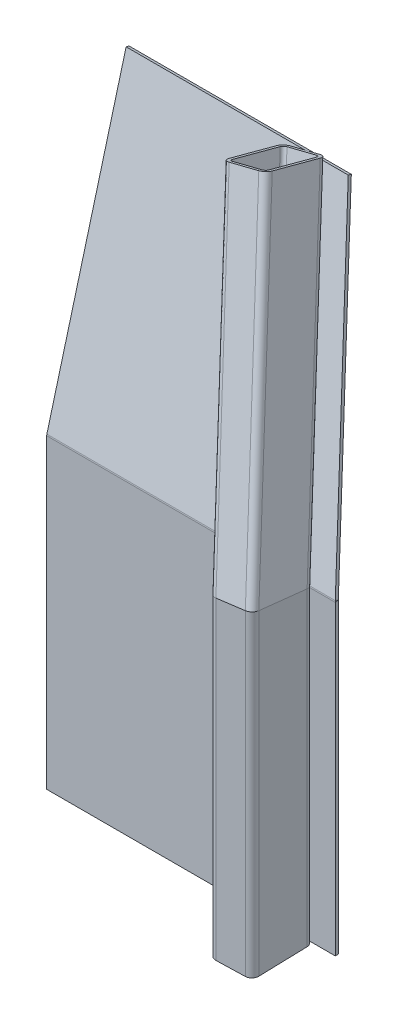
ISO-10303-21;
HEADER;
FILE_DESCRIPTION(('STEP AP214'),'2;1');
FILE_NAME('part.step','',(''),(''),'','','');
FILE_SCHEMA(('AUTOMOTIVE_DESIGN { 1 0 10303 214 1 1 1 1 }'));
ENDSEC;
DATA;
#1=APPLICATION_CONTEXT('core data for automotive mechanical design processes');
#2=APPLICATION_PROTOCOL_DEFINITION('international standard','automotive_design',2000,#1);
#3=PRODUCT_CONTEXT('',#1,'mechanical');
#4=PRODUCT('Part','Part','',(#3));
#5=PRODUCT_RELATED_PRODUCT_CATEGORY('part','',(#4));
#6=PRODUCT_DEFINITION_FORMATION('','',#4);
#7=PRODUCT_DEFINITION_CONTEXT('part definition',#1,'design');
#8=PRODUCT_DEFINITION('design','',#6,#7);
#9=PRODUCT_DEFINITION_SHAPE('','',#8);
#10=(LENGTH_UNIT() NAMED_UNIT(*) SI_UNIT(.MILLI.,.METRE.));
#11=(NAMED_UNIT(*) PLANE_ANGLE_UNIT() SI_UNIT($,.RADIAN.));
#12=(NAMED_UNIT(*) SI_UNIT($,.STERADIAN.) SOLID_ANGLE_UNIT());
#13=UNCERTAINTY_MEASURE_WITH_UNIT(LENGTH_MEASURE(1.E-05),#10,'distance_accuracy_value','');
#14=(GEOMETRIC_REPRESENTATION_CONTEXT(3) GLOBAL_UNCERTAINTY_ASSIGNED_CONTEXT((#13)) GLOBAL_UNIT_ASSIGNED_CONTEXT((#10,
#11,#12)) REPRESENTATION_CONTEXT('',''));
#15=CARTESIAN_POINT('',(0.,0.,0.));
#16=DIRECTION('',(0.,0.,1.));
#17=DIRECTION('',(1.,0.,0.));
#18=AXIS2_PLACEMENT_3D('',#15,#16,#17);
#19=CARTESIAN_POINT('',(216.323814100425,0.,9.87059137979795));
#20=DIRECTION('',(0.999603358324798,0.,-0.0281624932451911));
#21=DIRECTION('',(-0.0281624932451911,0.,-0.999603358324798));
#22=AXIS2_PLACEMENT_3D('',#19,#20,#21);
#23=PLANE('',#22);
#24=DIRECTION('',(-0.0279161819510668,-0.131968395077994,-0.990860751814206));
#25=VECTOR('',#24,1.);
#26=CARTESIAN_POINT('',(215.253700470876,285.413019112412,-28.1121670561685));
#27=LINE('',#26,#25);
#28=CARTESIAN_POINT('',(217.653083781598,296.755643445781,57.0518698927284));
#29=VERTEX_POINT('',#28);
#30=CARTESIAN_POINT('',(216.323814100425,290.471776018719,9.8705913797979));
#31=VERTEX_POINT('',#30);
#32=EDGE_CURVE('E13',#29,#31,#27,.T.);
#33=ORIENTED_EDGE('',*,*,#32,.F.);
#34=DIRECTION('',(0.,1.,0.));
#35=VECTOR('',#34,1.);
#36=CARTESIAN_POINT('',(217.653083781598,0.,57.0518698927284));
#37=LINE('',#36,#35);
#38=CARTESIAN_POINT('',(217.653083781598,0.,57.0518698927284));
#39=VERTEX_POINT('',#38);
#40=EDGE_CURVE('E237',#39,#29,#37,.T.);
#41=ORIENTED_EDGE('',*,*,#40,.F.);
#42=DIRECTION('',(-0.0281624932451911,0.,-0.999603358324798));
#43=VECTOR('',#42,1.);
#44=CARTESIAN_POINT('',(216.323814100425,0.,9.87059137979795));
#45=LINE('',#44,#43);
#46=CARTESIAN_POINT('',(216.323814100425,0.,9.87059137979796));
#47=VERTEX_POINT('',#46);
#48=EDGE_CURVE('E198',#39,#47,#45,.T.);
#49=ORIENTED_EDGE('',*,*,#48,.T.);
#50=DIRECTION('',(0.,1.,0.));
#51=VECTOR('',#50,1.);
#52=CARTESIAN_POINT('',(216.323814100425,0.,9.87059137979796));
#53=LINE('',#52,#51);
#54=EDGE_CURVE('E262',#47,#31,#53,.T.);
#55=ORIENTED_EDGE('',*,*,#54,.T.);
#56=EDGE_LOOP('',(#33,#41,#49,#55));
#57=FACE_BOUND('',#56,.T.);
#58=ADVANCED_FACE('F62',(#57),#23,.T.);
#59=CARTESIAN_POINT('',(219.522544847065,0.,9.78047140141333));
#60=DIRECTION('',(0.,1.,0.));
#61=DIRECTION('',(0.,0.,1.));
#62=AXIS2_PLACEMENT_3D('',#59,#60,#61);
#63=CYLINDRICAL_SURFACE('',#62,3.2);
#64=CARTESIAN_POINT('',(219.522544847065,290.808108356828,9.78047140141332));
#65=DIRECTION('',(0.107279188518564,-0.985917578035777,0.128287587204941));
#66=DIRECTION('',(0.632465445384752,0.167231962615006,0.756320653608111));
#67=AXIS2_PLACEMENT_3D('',#64,#65,#66);
#68=ELLIPSE('',#67,3.24570742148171,3.2);
#69=CARTESIAN_POINT('',(219.43242486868,290.382083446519,6.58174065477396));
#70=VERTEX_POINT('',#69);
#71=EDGE_CURVE('E295',#31,#70,#68,.T.);
#72=ORIENTED_EDGE('',*,*,#71,.F.);
#73=ORIENTED_EDGE('',*,*,#54,.F.);
#74=CARTESIAN_POINT('',(219.522544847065,0.,9.78047140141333));
#75=DIRECTION('',(0.,-1.,0.));
#76=DIRECTION('',(-0.0281624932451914,0.,-0.999603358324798));
#77=AXIS2_PLACEMENT_3D('',#74,#75,#76);
#78=CIRCLE('',#77,3.2);
#79=CARTESIAN_POINT('',(219.43242486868,0.,6.58174065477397));
#80=VERTEX_POINT('',#79);
#81=EDGE_CURVE('E216',#47,#80,#78,.T.);
#82=ORIENTED_EDGE('',*,*,#81,.T.);
#83=DIRECTION('',(0.,1.,0.));
#84=VECTOR('',#83,1.);
#85=CARTESIAN_POINT('',(219.43242486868,0.,6.58174065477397));
#86=LINE('',#85,#84);
#87=EDGE_CURVE('E265',#80,#70,#86,.T.);
#88=ORIENTED_EDGE('',*,*,#87,.T.);
#89=EDGE_LOOP('',(#72,#73,#82,#88));
#90=FACE_BOUND('',#89,.T.);
#91=ADVANCED_FACE('F294',(#90),#63,.F.);
#92=CARTESIAN_POINT('',(219.43242486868,0.,6.58174065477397));
#93=DIRECTION('',(0.0281624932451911,0.,0.999603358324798));
#94=DIRECTION('',(0.999603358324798,0.,-0.0281624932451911));
#95=AXIS2_PLACEMENT_3D('',#92,#93,#94);
#96=PLANE('',#95);
#97=DIRECTION('',(0.994127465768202,0.104528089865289,-0.0280082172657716));
#98=VECTOR('',#97,1.);
#99=CARTESIAN_POINT('',(189.25758988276,287.209333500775,7.43187644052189));
#100=LINE('',#99,#98);
#101=CARTESIAN_POINT('',(246.621636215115,293.24090832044,5.81572083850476));
#102=VERTEX_POINT('',#101);
#103=EDGE_CURVE('E291',#70,#102,#100,.T.);
#104=ORIENTED_EDGE('',*,*,#103,.F.);
#105=ORIENTED_EDGE('',*,*,#87,.F.);
#106=DIRECTION('',(0.999603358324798,0.,-0.0281624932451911));
#107=VECTOR('',#106,1.);
#108=CARTESIAN_POINT('',(219.43242486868,0.,6.58174065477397));
#109=LINE('',#108,#107);
#110=CARTESIAN_POINT('',(246.621636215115,0.,5.81572083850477));
#111=VERTEX_POINT('',#110);
#112=EDGE_CURVE('E213',#80,#111,#109,.T.);
#113=ORIENTED_EDGE('',*,*,#112,.T.);
#114=DIRECTION('',(0.,1.,0.));
#115=VECTOR('',#114,1.);
#116=CARTESIAN_POINT('',(246.621636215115,0.,5.81572083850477));
#117=LINE('',#116,#115);
#118=EDGE_CURVE('E268',#111,#102,#117,.T.);
#119=ORIENTED_EDGE('',*,*,#118,.T.);
#120=EDGE_LOOP('',(#104,#105,#113,#119));
#121=FACE_BOUND('',#120,.T.);
#122=ADVANCED_FACE('F290',(#121),#96,.T.);
#123=CARTESIAN_POINT('',(246.711756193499,0.,9.01445158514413));
#124=DIRECTION('',(0.,1.,0.));
#125=DIRECTION('',(0.,0.,1.));
#126=AXIS2_PLACEMENT_3D('',#123,#124,#125);
#127=CYLINDRICAL_SURFACE('',#126,3.2);
#128=CARTESIAN_POINT('',(246.711756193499,293.666933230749,9.01445158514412));
#129=DIRECTION('',(0.107279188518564,-0.985917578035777,0.128287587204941));
#130=DIRECTION('',(0.632465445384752,0.167231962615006,0.756320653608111));
#131=AXIS2_PLACEMENT_3D('',#128,#129,#130);
#132=ELLIPSE('',#131,3.24570742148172,3.2);
#133=CARTESIAN_POINT('',(249.910486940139,294.003265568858,8.9243316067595));
#134=VERTEX_POINT('',#133);
#135=EDGE_CURVE('E286',#102,#134,#132,.T.);
#136=ORIENTED_EDGE('',*,*,#135,.F.);
#137=ORIENTED_EDGE('',*,*,#118,.F.);
#138=CARTESIAN_POINT('',(246.711756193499,0.,9.01445158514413));
#139=DIRECTION('',(0.,-1.,0.));
#140=DIRECTION('',(-0.0281624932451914,0.,-0.999603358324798));
#141=AXIS2_PLACEMENT_3D('',#138,#139,#140);
#142=CIRCLE('',#141,3.2);
#143=CARTESIAN_POINT('',(249.910486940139,0.,8.92433160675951));
#144=VERTEX_POINT('',#143);
#145=EDGE_CURVE('E210',#111,#144,#142,.T.);
#146=ORIENTED_EDGE('',*,*,#145,.T.);
#147=DIRECTION('',(0.,1.,0.));
#148=VECTOR('',#147,1.);
#149=CARTESIAN_POINT('',(249.910486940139,0.,8.92433160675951));
#150=LINE('',#149,#148);
#151=EDGE_CURVE('E271',#144,#134,#150,.T.);
#152=ORIENTED_EDGE('',*,*,#151,.T.);
#153=EDGE_LOOP('',(#136,#137,#146,#152));
#154=FACE_BOUND('',#153,.T.);
#155=ADVANCED_FACE('F285',(#154),#127,.F.);
#156=CARTESIAN_POINT('',(251.239756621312,0.,56.10561011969));
#157=DIRECTION('',(-0.999603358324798,0.,0.0281624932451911));
#158=DIRECTION('',(0.0281624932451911,0.,0.999603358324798));
#159=AXIS2_PLACEMENT_3D('',#156,#157,#158);
#160=PLANE('',#159);
#161=DIRECTION('',(0.0279161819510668,0.131968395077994,0.990860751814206));
#162=VECTOR('',#161,1.);
#163=CARTESIAN_POINT('',(250.133482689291,295.057435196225,16.8393729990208));
#164=LINE('',#163,#162);
#165=CARTESIAN_POINT('',(251.239756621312,300.287132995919,56.10561011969));
#166=VERTEX_POINT('',#165);
#167=EDGE_CURVE('E117',#134,#166,#164,.T.);
#168=ORIENTED_EDGE('',*,*,#167,.F.);
#169=ORIENTED_EDGE('',*,*,#151,.F.);
#170=DIRECTION('',(0.0281624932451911,0.,0.999603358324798));
#171=VECTOR('',#170,1.);
#172=CARTESIAN_POINT('',(251.239756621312,0.,56.10561011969));
#173=LINE('',#172,#171);
#174=CARTESIAN_POINT('',(251.239756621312,0.,56.10561011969));
#175=VERTEX_POINT('',#174);
#176=EDGE_CURVE('E204',#144,#175,#173,.T.);
#177=ORIENTED_EDGE('',*,*,#176,.T.);
#178=DIRECTION('',(0.,1.,0.));
#179=VECTOR('',#178,1.);
#180=CARTESIAN_POINT('',(251.239756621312,0.,56.10561011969));
#181=LINE('',#180,#179);
#182=EDGE_CURVE('E274',#175,#166,#181,.T.);
#183=ORIENTED_EDGE('',*,*,#182,.T.);
#184=EDGE_LOOP('',(#168,#169,#177,#183));
#185=FACE_BOUND('',#184,.T.);
#186=ADVANCED_FACE('F282',(#185),#160,.T.);
#187=CARTESIAN_POINT('',(248.041025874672,0.,56.1957300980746));
#188=DIRECTION('',(0.,1.,0.));
#189=DIRECTION('',(0.,0.,1.));
#190=AXIS2_PLACEMENT_3D('',#187,#188,#189);
#191=CYLINDRICAL_SURFACE('',#190,3.2);
#192=CARTESIAN_POINT('',(248.041025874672,299.950800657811,56.1957300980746));
#193=DIRECTION('',(0.107279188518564,-0.985917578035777,0.128287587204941));
#194=DIRECTION('',(0.632465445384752,0.167231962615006,0.756320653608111));
#195=AXIS2_PLACEMENT_3D('',#192,#193,#194);
#196=ELLIPSE('',#195,3.24570742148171,3.2);
#197=CARTESIAN_POINT('',(248.131145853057,300.37682556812,59.3944608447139));
#198=VERTEX_POINT('',#197);
#199=EDGE_CURVE('E120',#166,#198,#196,.T.);
#200=ORIENTED_EDGE('',*,*,#199,.F.);
#201=ORIENTED_EDGE('',*,*,#182,.F.);
#202=CARTESIAN_POINT('',(248.041025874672,0.,56.1957300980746));
#203=DIRECTION('',(0.,-1.,0.));
#204=DIRECTION('',(-0.0281624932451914,0.,-0.999603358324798));
#205=AXIS2_PLACEMENT_3D('',#202,#203,#204);
#206=CIRCLE('',#205,3.2);
#207=CARTESIAN_POINT('',(248.131145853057,0.,59.3944608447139));
#208=VERTEX_POINT('',#207);
#209=EDGE_CURVE('E202',#175,#208,#206,.T.);
#210=ORIENTED_EDGE('',*,*,#209,.T.);
#211=DIRECTION('',(0.,1.,0.));
#212=VECTOR('',#211,1.);
#213=CARTESIAN_POINT('',(248.131145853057,0.,59.3944608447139));
#214=LINE('',#213,#212);
#215=EDGE_CURVE('E188',#208,#198,#214,.T.);
#216=ORIENTED_EDGE('',*,*,#215,.T.);
#217=EDGE_LOOP('',(#200,#201,#210,#216));
#218=FACE_BOUND('',#217,.T.);
#219=ADVANCED_FACE('F278',(#218),#191,.F.);
#220=CARTESIAN_POINT('',(248.131145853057,0.,59.3944608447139));
#221=DIRECTION('',(-0.0281624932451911,0.,-0.999603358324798));
#222=DIRECTION('',(-0.999603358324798,0.,0.0281624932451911));
#223=AXIS2_PLACEMENT_3D('',#220,#221,#222);
#224=PLANE('',#223);
#225=DIRECTION('',(-0.994127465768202,-0.104528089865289,0.0280082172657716));
#226=VECTOR('',#225,1.);
#227=CARTESIAN_POINT('',(216.917714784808,297.094871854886,60.2738576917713));
#228=LINE('',#227,#226);
#229=CARTESIAN_POINT('',(220.941934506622,297.518000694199,60.1604806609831));
#230=VERTEX_POINT('',#229);
#231=EDGE_CURVE('E124',#198,#230,#228,.T.);
#232=ORIENTED_EDGE('',*,*,#231,.F.);
#233=ORIENTED_EDGE('',*,*,#215,.F.);
#234=DIRECTION('',(-0.999603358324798,0.,0.0281624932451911));
#235=VECTOR('',#234,1.);
#236=CARTESIAN_POINT('',(248.131145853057,0.,59.3944608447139));
#237=LINE('',#236,#235);
#238=CARTESIAN_POINT('',(220.941934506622,0.,60.1604806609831));
#239=VERTEX_POINT('',#238);
#240=EDGE_CURVE('E194',#208,#239,#237,.T.);
#241=ORIENTED_EDGE('',*,*,#240,.T.);
#242=DIRECTION('',(0.,1.,0.));
#243=VECTOR('',#242,1.);
#244=CARTESIAN_POINT('',(220.941934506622,0.,60.1604806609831));
#245=LINE('',#244,#243);
#246=EDGE_CURVE('E181',#239,#230,#245,.T.);
#247=ORIENTED_EDGE('',*,*,#246,.T.);
#248=EDGE_LOOP('',(#232,#233,#241,#247));
#249=FACE_BOUND('',#248,.T.);
#250=ADVANCED_FACE('F200',(#249),#224,.T.);
#251=CARTESIAN_POINT('',(220.851814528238,0.,56.9617499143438));
#252=DIRECTION('',(0.,1.,0.));
#253=DIRECTION('',(0.,0.,1.));
#254=AXIS2_PLACEMENT_3D('',#251,#252,#253);
#255=CYLINDRICAL_SURFACE('',#254,3.2);
#256=CARTESIAN_POINT('',(220.851814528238,297.09197578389,56.9617499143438));
#257=DIRECTION('',(0.107279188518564,-0.985917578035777,0.128287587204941));
#258=DIRECTION('',(0.632465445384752,0.167231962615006,0.756320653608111));
#259=AXIS2_PLACEMENT_3D('',#256,#257,#258);
#260=ELLIPSE('',#259,3.24570742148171,3.2);
#261=EDGE_CURVE('E127',#230,#29,#260,.T.);
#262=ORIENTED_EDGE('',*,*,#261,.F.);
#263=ORIENTED_EDGE('',*,*,#246,.F.);
#264=CARTESIAN_POINT('',(220.851814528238,0.,56.9617499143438));
#265=DIRECTION('',(0.,-1.,0.));
#266=DIRECTION('',(-0.0281624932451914,0.,-0.999603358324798));
#267=AXIS2_PLACEMENT_3D('',#264,#265,#266);
#268=CIRCLE('',#267,3.2);
#269=EDGE_CURVE('E183',#239,#39,#268,.T.);
#270=ORIENTED_EDGE('',*,*,#269,.T.);
#271=ORIENTED_EDGE('',*,*,#40,.T.);
#272=EDGE_LOOP('',(#262,#263,#270,#271));
#273=FACE_BOUND('',#272,.T.);
#274=ADVANCED_FACE('F64',(#273),#255,.F.);
#275=CARTESIAN_POINT('',(248.041025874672,0.,56.1957300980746));
#276=DIRECTION('',(0.,-1.,0.));
#277=DIRECTION('',(-0.0281624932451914,0.,-0.999603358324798));
#278=AXIS2_PLACEMENT_3D('',#275,#276,#277);
#279=PLANE('',#278);
#280=ORIENTED_EDGE('',*,*,#269,.F.);
#281=ORIENTED_EDGE('',*,*,#240,.F.);
#282=ORIENTED_EDGE('',*,*,#209,.F.);
#283=ORIENTED_EDGE('',*,*,#176,.F.);
#284=ORIENTED_EDGE('',*,*,#145,.F.);
#285=ORIENTED_EDGE('',*,*,#112,.F.);
#286=ORIENTED_EDGE('',*,*,#81,.F.);
#287=ORIENTED_EDGE('',*,*,#48,.F.);
#288=EDGE_LOOP('',(#280,#281,#282,#283,#284,#285,#286,#287));
#289=FACE_BOUND('',#288,.T.);
#290=CARTESIAN_POINT('',(248.041025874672,0.,56.1957300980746));
#291=DIRECTION('',(0.,-1.,0.));
#292=DIRECTION('',(-0.0281624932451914,0.,-0.999603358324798));
#293=AXIS2_PLACEMENT_3D('',#290,#291,#292);
#294=CIRCLE('',#293,6.40000000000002);
#295=CARTESIAN_POINT('',(254.438487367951,0.,56.0154901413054));
#296=VERTEX_POINT('',#295);
#297=CARTESIAN_POINT('',(248.221265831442,0.,62.5931915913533));
#298=VERTEX_POINT('',#297);
#299=EDGE_CURVE('E220',#296,#298,#294,.T.);
#300=ORIENTED_EDGE('',*,*,#299,.T.);
#301=DIRECTION('',(-0.999603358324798,0.,0.0281624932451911));
#302=VECTOR('',#301,1.);
#303=CARTESIAN_POINT('',(248.221265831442,0.,62.5931915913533));
#304=LINE('',#303,#302);
#305=CARTESIAN_POINT('',(221.032054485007,-1.66533453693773E-13,63.3592114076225));
#306=VERTEX_POINT('',#305);
#307=EDGE_CURVE('E223',#298,#306,#304,.T.);
#308=ORIENTED_EDGE('',*,*,#307,.T.);
#309=CARTESIAN_POINT('',(220.851814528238,0.,56.9617499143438));
#310=DIRECTION('',(0.,-1.,0.));
#311=DIRECTION('',(-0.0281624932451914,0.,-0.999603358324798));
#312=AXIS2_PLACEMENT_3D('',#309,#310,#311);
#313=CIRCLE('',#312,6.40000000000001);
#314=CARTESIAN_POINT('',(214.454353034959,0.,57.141989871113));
#315=VERTEX_POINT('',#314);
#316=EDGE_CURVE('E225',#306,#315,#313,.T.);
#317=ORIENTED_EDGE('',*,*,#316,.T.);
#318=DIRECTION('',(-0.0281624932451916,0.,-0.999603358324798));
#319=VECTOR('',#318,1.);
#320=CARTESIAN_POINT('',(213.125083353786,0.,9.96071135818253));
#321=LINE('',#320,#319);
#322=CARTESIAN_POINT('',(213.125083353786,0.,9.96071135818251));
#323=VERTEX_POINT('',#322);
#324=EDGE_CURVE('E227',#315,#323,#321,.T.);
#325=ORIENTED_EDGE('',*,*,#324,.T.);
#326=CARTESIAN_POINT('',(219.522544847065,0.,9.78047140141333));
#327=DIRECTION('',(0.,-1.,0.));
#328=DIRECTION('',(-0.0281624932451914,0.,-0.999603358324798));
#329=AXIS2_PLACEMENT_3D('',#326,#327,#328);
#330=CIRCLE('',#329,6.40000000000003);
#331=CARTESIAN_POINT('',(219.342304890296,0.,3.3830099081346));
#332=VERTEX_POINT('',#331);
#333=EDGE_CURVE('E229',#323,#332,#330,.T.);
#334=ORIENTED_EDGE('',*,*,#333,.T.);
#335=DIRECTION('',(0.999603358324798,0.,-0.0281624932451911));
#336=VECTOR('',#335,1.);
#337=CARTESIAN_POINT('',(219.342304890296,0.,3.3830099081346));
#338=LINE('',#337,#336);
#339=CARTESIAN_POINT('',(246.53151623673,0.,2.61699009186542));
#340=VERTEX_POINT('',#339);
#341=EDGE_CURVE('E231',#332,#340,#338,.T.);
#342=ORIENTED_EDGE('',*,*,#341,.T.);
#343=CARTESIAN_POINT('',(246.711756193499,0.,9.01445158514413));
#344=DIRECTION('',(0.,-1.,0.));
#345=DIRECTION('',(-0.0281624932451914,0.,-0.999603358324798));
#346=AXIS2_PLACEMENT_3D('',#343,#344,#345);
#347=CIRCLE('',#346,6.40000000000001);
#348=CARTESIAN_POINT('',(253.109217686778,0.,8.83421162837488));
#349=VERTEX_POINT('',#348);
#350=EDGE_CURVE('E233',#340,#349,#347,.T.);
#351=ORIENTED_EDGE('',*,*,#350,.T.);
#352=DIRECTION('',(0.0281624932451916,0.,0.999603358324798));
#353=VECTOR('',#352,1.);
#354=CARTESIAN_POINT('',(254.438487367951,0.,56.0154901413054));
#355=LINE('',#354,#353);
#356=EDGE_CURVE('E235',#349,#296,#355,.T.);
#357=ORIENTED_EDGE('',*,*,#356,.T.);
#358=EDGE_LOOP('',(#300,#308,#317,#325,#334,#342,#351,#357));
#359=FACE_BOUND('',#358,.T.);
#360=ADVANCED_FACE('F191',(#289,#359),#279,.T.);
#361=CARTESIAN_POINT('',(254.438487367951,0.,56.0154901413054));
#362=DIRECTION('',(-0.999603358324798,0.,0.0281624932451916));
#363=DIRECTION('',(0.0281624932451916,0.,0.999603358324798));
#364=AXIS2_PLACEMENT_3D('',#361,#362,#363);
#365=PLANE('',#364);
#366=DIRECTION('',(0.,1.,0.));
#367=VECTOR('',#366,1.);
#368=CARTESIAN_POINT('',(253.109217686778,0.,8.83421162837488));
#369=LINE('',#368,#367);
#370=CARTESIAN_POINT('',(253.109217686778,294.339597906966,8.83421162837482));
#371=VERTEX_POINT('',#370);
#372=EDGE_CURVE('E240',#349,#371,#369,.T.);
#373=ORIENTED_EDGE('',*,*,#372,.T.);
#374=DIRECTION('',(0.0279161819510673,0.131968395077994,0.990860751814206));
#375=VECTOR('',#374,1.);
#376=CARTESIAN_POINT('',(253.330974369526,295.387910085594,16.7052734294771));
#377=LINE('',#376,#375);
#378=CARTESIAN_POINT('',(254.438487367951,300.623465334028,56.0154901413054));
#379=VERTEX_POINT('',#378);
#380=EDGE_CURVE('E66',#371,#379,#377,.T.);
#381=ORIENTED_EDGE('',*,*,#380,.T.);
#382=DIRECTION('',(0.,1.,0.));
#383=VECTOR('',#382,1.);
#384=CARTESIAN_POINT('',(254.438487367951,0.,56.0154901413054));
#385=LINE('',#384,#383);
#386=EDGE_CURVE('E187',#296,#379,#385,.T.);
#387=ORIENTED_EDGE('',*,*,#386,.F.);
#388=ORIENTED_EDGE('',*,*,#356,.F.);
#389=EDGE_LOOP('',(#373,#381,#387,#388));
#390=FACE_BOUND('',#389,.T.);
#391=ADVANCED_FACE('F333',(#390),#365,.F.);
#392=CARTESIAN_POINT('',(246.711756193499,0.,9.01445158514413));
#393=DIRECTION('',(0.,1.,0.));
#394=DIRECTION('',(0.,0.,1.));
#395=AXIS2_PLACEMENT_3D('',#392,#393,#394);
#396=CYLINDRICAL_SURFACE('',#395,6.40000000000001);
#397=DIRECTION('',(0.,1.,0.));
#398=VECTOR('',#397,1.);
#399=CARTESIAN_POINT('',(246.53151623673,0.,2.61699009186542));
#400=LINE('',#399,#398);
#401=CARTESIAN_POINT('',(246.53151623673,292.814883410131,2.6169900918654));
#402=VERTEX_POINT('',#401);
#403=EDGE_CURVE('E243',#340,#402,#400,.T.);
#404=ORIENTED_EDGE('',*,*,#403,.T.);
#405=CARTESIAN_POINT('',(246.711756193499,293.666933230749,9.01445158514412));
#406=DIRECTION('',(0.107279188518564,-0.985917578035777,0.128287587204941));
#407=DIRECTION('',(0.632465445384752,0.167231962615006,0.756320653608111));
#408=AXIS2_PLACEMENT_3D('',#405,#406,#407);
#409=ELLIPSE('',#408,6.49141484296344,6.40000000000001);
#410=EDGE_CURVE('E72',#402,#371,#409,.T.);
#411=ORIENTED_EDGE('',*,*,#410,.T.);
#412=ORIENTED_EDGE('',*,*,#372,.F.);
#413=ORIENTED_EDGE('',*,*,#350,.F.);
#414=EDGE_LOOP('',(#404,#411,#412,#413));
#415=FACE_BOUND('',#414,.T.);
#416=ADVANCED_FACE('F328',(#415),#396,.T.);
#417=CARTESIAN_POINT('',(219.342304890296,0.,3.3830099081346));
#418=DIRECTION('',(0.0281624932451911,0.,0.999603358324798));
#419=DIRECTION('',(0.999603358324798,0.,-0.0281624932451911));
#420=AXIS2_PLACEMENT_3D('',#417,#418,#419);
#421=PLANE('',#420);
#422=DIRECTION('',(0.,1.,0.));
#423=VECTOR('',#422,1.);
#424=CARTESIAN_POINT('',(219.342304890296,0.,3.3830099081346));
#425=LINE('',#424,#423);
#426=CARTESIAN_POINT('',(219.342304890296,289.956058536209,3.38300990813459));
#427=VERTEX_POINT('',#426);
#428=EDGE_CURVE('E246',#332,#427,#425,.T.);
#429=ORIENTED_EDGE('',*,*,#428,.T.);
#430=DIRECTION('',(0.994127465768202,0.104528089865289,-0.0280082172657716));
#431=VECTOR('',#430,1.);
#432=CARTESIAN_POINT('',(189.211739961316,286.787963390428,4.2318984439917));
#433=LINE('',#432,#431);
#434=EDGE_CURVE('E323',#427,#402,#433,.T.);
#435=ORIENTED_EDGE('',*,*,#434,.T.);
#436=ORIENTED_EDGE('',*,*,#403,.F.);
#437=ORIENTED_EDGE('',*,*,#341,.F.);
#438=EDGE_LOOP('',(#429,#435,#436,#437));
#439=FACE_BOUND('',#438,.T.);
#440=ADVANCED_FACE('F340',(#439),#421,.F.);
#441=CARTESIAN_POINT('',(219.522544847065,0.,9.78047140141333));
#442=DIRECTION('',(0.,1.,0.));
#443=DIRECTION('',(0.,0.,1.));
#444=AXIS2_PLACEMENT_3D('',#441,#442,#443);
#445=CYLINDRICAL_SURFACE('',#444,6.40000000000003);
#446=DIRECTION('',(0.,1.,0.));
#447=VECTOR('',#446,1.);
#448=CARTESIAN_POINT('',(213.125083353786,0.,9.96071135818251));
#449=LINE('',#448,#447);
#450=CARTESIAN_POINT('',(213.125083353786,290.135443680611,9.9607113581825));
#451=VERTEX_POINT('',#450);
#452=EDGE_CURVE('E249',#323,#451,#449,.T.);
#453=ORIENTED_EDGE('',*,*,#452,.T.);
#454=CARTESIAN_POINT('',(219.522544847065,290.808108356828,9.78047140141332));
#455=DIRECTION('',(0.107279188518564,-0.985917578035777,0.128287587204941));
#456=DIRECTION('',(0.632465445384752,0.167231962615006,0.756320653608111));
#457=AXIS2_PLACEMENT_3D('',#454,#455,#456);
#458=ELLIPSE('',#457,6.49141484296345,6.40000000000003);
#459=EDGE_CURVE('E320',#451,#427,#458,.T.);
#460=ORIENTED_EDGE('',*,*,#459,.T.);
#461=ORIENTED_EDGE('',*,*,#428,.F.);
#462=ORIENTED_EDGE('',*,*,#333,.F.);
#463=EDGE_LOOP('',(#453,#460,#461,#462));
#464=FACE_BOUND('',#463,.T.);
#465=ADVANCED_FACE('F343',(#464),#445,.T.);
#466=CARTESIAN_POINT('',(213.125083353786,0.,9.96071135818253));
#467=DIRECTION('',(0.999603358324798,0.,-0.0281624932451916));
#468=DIRECTION('',(-0.0281624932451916,0.,-0.999603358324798));
#469=AXIS2_PLACEMENT_3D('',#466,#467,#468);
#470=PLANE('',#469);
#471=DIRECTION('',(0.,1.,0.));
#472=VECTOR('',#471,1.);
#473=CARTESIAN_POINT('',(214.454353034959,0.,57.141989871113));
#474=LINE('',#473,#472);
#475=CARTESIAN_POINT('',(214.454353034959,296.419311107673,57.141989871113));
#476=VERTEX_POINT('',#475);
#477=EDGE_CURVE('E252',#315,#476,#474,.T.);
#478=ORIENTED_EDGE('',*,*,#477,.T.);
#479=DIRECTION('',(-0.0279161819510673,-0.131968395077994,-0.990860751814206));
#480=VECTOR('',#479,1.);
#481=CARTESIAN_POINT('',(212.056208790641,285.082544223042,-27.9780674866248));
#482=LINE('',#481,#480);
#483=EDGE_CURVE('E317',#476,#451,#482,.T.);
#484=ORIENTED_EDGE('',*,*,#483,.T.);
#485=ORIENTED_EDGE('',*,*,#452,.F.);
#486=ORIENTED_EDGE('',*,*,#324,.F.);
#487=EDGE_LOOP('',(#478,#484,#485,#486));
#488=FACE_BOUND('',#487,.T.);
#489=ADVANCED_FACE('F346',(#488),#470,.F.);
#490=CARTESIAN_POINT('',(220.851814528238,0.,56.9617499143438));
#491=DIRECTION('',(0.,1.,0.));
#492=DIRECTION('',(0.,0.,1.));
#493=AXIS2_PLACEMENT_3D('',#490,#491,#492);
#494=CYLINDRICAL_SURFACE('',#493,6.40000000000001);
#495=DIRECTION('',(0.,1.,0.));
#496=VECTOR('',#495,1.);
#497=CARTESIAN_POINT('',(221.032054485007,-1.66533453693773E-13,63.3592114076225));
#498=LINE('',#497,#496);
#499=CARTESIAN_POINT('',(221.032054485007,297.944025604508,63.3592114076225));
#500=VERTEX_POINT('',#499);
#501=EDGE_CURVE('E255',#306,#500,#498,.T.);
#502=ORIENTED_EDGE('',*,*,#501,.T.);
#503=CARTESIAN_POINT('',(220.851814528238,297.09197578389,56.9617499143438));
#504=DIRECTION('',(0.107279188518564,-0.985917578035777,0.128287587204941));
#505=DIRECTION('',(0.632465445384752,0.167231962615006,0.756320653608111));
#506=AXIS2_PLACEMENT_3D('',#503,#504,#505);
#507=ELLIPSE('',#506,6.49141484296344,6.40000000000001);
#508=EDGE_CURVE('E312',#500,#476,#507,.T.);
#509=ORIENTED_EDGE('',*,*,#508,.T.);
#510=ORIENTED_EDGE('',*,*,#477,.F.);
#511=ORIENTED_EDGE('',*,*,#316,.F.);
#512=EDGE_LOOP('',(#502,#509,#510,#511));
#513=FACE_BOUND('',#512,.T.);
#514=ADVANCED_FACE('F350',(#513),#494,.T.);
#515=CARTESIAN_POINT('',(248.221265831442,0.,62.5931915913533));
#516=DIRECTION('',(-0.0281624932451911,0.,-0.999603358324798));
#517=DIRECTION('',(-0.999603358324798,0.,0.0281624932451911));
#518=AXIS2_PLACEMENT_3D('',#515,#516,#517);
#519=PLANE('',#518);
#520=DIRECTION('',(0.,1.,0.));
#521=VECTOR('',#520,1.);
#522=CARTESIAN_POINT('',(248.221265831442,0.,62.5931915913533));
#523=LINE('',#522,#521);
#524=CARTESIAN_POINT('',(248.221265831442,300.80285047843,62.5931915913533));
#525=VERTEX_POINT('',#524);
#526=EDGE_CURVE('E258',#298,#525,#523,.T.);
#527=ORIENTED_EDGE('',*,*,#526,.T.);
#528=DIRECTION('',(-0.994127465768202,-0.104528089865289,0.0280082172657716));
#529=VECTOR('',#528,1.);
#530=CARTESIAN_POINT('',(216.963564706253,297.516241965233,63.4738356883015));
#531=LINE('',#530,#529);
#532=EDGE_CURVE('E308',#525,#500,#531,.T.);
#533=ORIENTED_EDGE('',*,*,#532,.T.);
#534=ORIENTED_EDGE('',*,*,#501,.F.);
#535=ORIENTED_EDGE('',*,*,#307,.F.);
#536=EDGE_LOOP('',(#527,#533,#534,#535));
#537=FACE_BOUND('',#536,.T.);
#538=ADVANCED_FACE('F353',(#537),#519,.F.);
#539=CARTESIAN_POINT('',(248.041025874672,0.,56.1957300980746));
#540=DIRECTION('',(0.,1.,0.));
#541=DIRECTION('',(0.,0.,1.));
#542=AXIS2_PLACEMENT_3D('',#539,#540,#541);
#543=CYLINDRICAL_SURFACE('',#542,6.40000000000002);
#544=ORIENTED_EDGE('',*,*,#386,.T.);
#545=CARTESIAN_POINT('',(248.041025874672,299.950800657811,56.1957300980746));
#546=DIRECTION('',(0.107279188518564,-0.985917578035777,0.128287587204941));
#547=DIRECTION('',(0.632465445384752,0.167231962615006,0.756320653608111));
#548=AXIS2_PLACEMENT_3D('',#545,#546,#547);
#549=ELLIPSE('',#548,6.49141484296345,6.40000000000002);
#550=EDGE_CURVE('E306',#379,#525,#549,.T.);
#551=ORIENTED_EDGE('',*,*,#550,.T.);
#552=ORIENTED_EDGE('',*,*,#526,.F.);
#553=ORIENTED_EDGE('',*,*,#299,.F.);
#554=EDGE_LOOP('',(#544,#551,#552,#553));
#555=FACE_BOUND('',#554,.T.);
#556=ADVANCED_FACE('F354',(#555),#543,.T.);
#557=CARTESIAN_POINT('',(232.936910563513,291.38547097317,2.99999999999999));
#558=DIRECTION('',(0.107279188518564,-0.985917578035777,0.128287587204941));
#559=DIRECTION('',(0.,-0.129032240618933,-0.991640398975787));
#560=AXIS2_PLACEMENT_3D('',#557,#558,#559);
#561=PLANE('',#560);
#562=ORIENTED_EDGE('',*,*,#261,.T.);
#563=ORIENTED_EDGE('',*,*,#32,.T.);
#564=ORIENTED_EDGE('',*,*,#71,.T.);
#565=ORIENTED_EDGE('',*,*,#103,.T.);
#566=ORIENTED_EDGE('',*,*,#135,.T.);
#567=ORIENTED_EDGE('',*,*,#167,.T.);
#568=ORIENTED_EDGE('',*,*,#199,.T.);
#569=ORIENTED_EDGE('',*,*,#231,.T.);
#570=EDGE_LOOP('',(#562,#563,#564,#565,#566,#567,#568,#569));
#571=FACE_BOUND('',#570,.T.);
#572=ORIENTED_EDGE('',*,*,#380,.F.);
#573=ORIENTED_EDGE('',*,*,#410,.F.);
#574=ORIENTED_EDGE('',*,*,#434,.F.);
#575=ORIENTED_EDGE('',*,*,#459,.F.);
#576=ORIENTED_EDGE('',*,*,#483,.F.);
#577=ORIENTED_EDGE('',*,*,#508,.F.);
#578=ORIENTED_EDGE('',*,*,#532,.F.);
#579=ORIENTED_EDGE('',*,*,#550,.F.);
#580=EDGE_LOOP('',(#572,#573,#574,#575,#576,#577,#578,#579));
#581=FACE_BOUND('',#580,.T.);
#582=ADVANCED_FACE('F298',(#571,#581),#561,.F.);
#583=CLOSED_SHELL('',(#58,#91,#122,#155,#186,#219,#250,#274,#360,#391,#416,#440,#465,#489,#514,
#538,#556,#582));
#584=MANIFOLD_SOLID_BREP('B2',#583);
#585=CARTESIAN_POINT('',(246.229142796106,308.037045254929,54.0290273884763));
#586=DIRECTION('',(-0.211536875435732,0.944066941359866,-0.252961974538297));
#587=DIRECTION('',(0.,0.258819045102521,0.965925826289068));
#588=AXIS2_PLACEMENT_3D('',#585,#586,#587);
#589=CYLINDRICAL_SURFACE('',#588,6.40000000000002);
#590=CARTESIAN_POINT('',(248.041025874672,299.950800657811,56.1957300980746));
#591=DIRECTION('',(0.107279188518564,-0.985917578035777,0.128287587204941));
#592=DIRECTION('',(-0.632465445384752,-0.167231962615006,-0.756320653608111));
#593=AXIS2_PLACEMENT_3D('',#590,#591,#592);
#594=ELLIPSE('',#593,6.49141484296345,6.40000000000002);
#595=CARTESIAN_POINT('',(254.438487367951,300.623465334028,56.0154901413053));
#596=VERTEX_POINT('',#595);
#597=CARTESIAN_POINT('',(248.221265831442,300.80285047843,62.5931915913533));
#598=VERTEX_POINT('',#597);
#599=EDGE_CURVE('E674',#596,#598,#594,.T.);
#600=ORIENTED_EDGE('',*,*,#599,.F.);
#601=DIRECTION('',(-0.211536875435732,0.944066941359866,-0.252961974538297));
#602=VECTOR('',#601,1.);
#603=CARTESIAN_POINT('',(252.484310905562,309.344750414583,53.6786288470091));
#604=LINE('',#603,#602);
#605=CARTESIAN_POINT('',(189.418357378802,590.801502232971,-21.7374805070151));
#606=VERTEX_POINT('',#605);
#607=EDGE_CURVE('E670',#596,#606,#604,.T.);
#608=ORIENTED_EDGE('',*,*,#607,.T.);
#609=CARTESIAN_POINT('',(183.163189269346,589.493797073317,-21.387081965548));
#610=DIRECTION('',(0.211536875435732,-0.944066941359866,0.252961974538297));
#611=DIRECTION('',(0.,-0.258819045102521,-0.965925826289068));
#612=AXIS2_PLACEMENT_3D('',#609,#610,#611);
#613=CIRCLE('',#612,6.40000000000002);
#614=CARTESIAN_POINT('',(183.163189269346,591.150238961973,-15.2051566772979));
#615=VERTEX_POINT('',#614);
#616=EDGE_CURVE('E725',#606,#615,#613,.T.);
#617=ORIENTED_EDGE('',*,*,#616,.T.);
#618=DIRECTION('',(-0.211536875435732,0.944066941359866,-0.252961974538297));
#619=VECTOR('',#618,1.);
#620=CARTESIAN_POINT('',(246.229142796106,309.693487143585,60.2109526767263));
#621=LINE('',#620,#619);
#622=EDGE_CURVE('E722',#598,#615,#621,.T.);
#623=ORIENTED_EDGE('',*,*,#622,.F.);
#624=EDGE_LOOP('',(#600,#608,#617,#623));
#625=FACE_BOUND('',#624,.T.);
#626=ADVANCED_FACE('F545',(#625),#589,.T.);
#627=CARTESIAN_POINT('',(246.229142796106,309.693487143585,60.2109526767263));
#628=DIRECTION('',(0.,-0.258819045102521,-0.965925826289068));
#629=DIRECTION('',(0.,0.965925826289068,-0.258819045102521));
#630=AXIS2_PLACEMENT_3D('',#627,#628,#629);
#631=PLANE('',#630);
#632=DIRECTION('',(-0.994127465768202,-0.104528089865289,0.0280082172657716));
#633=VECTOR('',#632,1.);
#634=CARTESIAN_POINT('',(247.242665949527,300.699955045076,62.6207623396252));
#635=LINE('',#634,#633);
#636=CARTESIAN_POINT('',(221.032054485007,297.944025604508,63.3592114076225));
#637=VERTEX_POINT('',#636);
#638=EDGE_CURVE('E692',#598,#637,#635,.T.);
#639=ORIENTED_EDGE('',*,*,#638,.F.);
#640=ORIENTED_EDGE('',*,*,#622,.T.);
#641=DIRECTION('',(-0.977370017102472,-0.204328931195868,0.0547497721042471));
#642=VECTOR('',#641,1.);
#643=CARTESIAN_POINT('',(183.163189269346,591.150238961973,-15.2051566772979));
#644=LINE('',#643,#642);
#645=CARTESIAN_POINT('',(156.578724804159,585.592492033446,-13.7159628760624));
#646=VERTEX_POINT('',#645);
#647=EDGE_CURVE('E724',#615,#646,#644,.T.);
#648=ORIENTED_EDGE('',*,*,#647,.T.);
#649=DIRECTION('',(-0.211536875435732,0.944066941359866,-0.252961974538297));
#650=VECTOR('',#649,1.);
#651=CARTESIAN_POINT('',(219.644678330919,304.135740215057,61.7001464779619));
#652=LINE('',#651,#650);
#653=EDGE_CURVE('E726',#637,#646,#652,.T.);
#654=ORIENTED_EDGE('',*,*,#653,.F.);
#655=EDGE_LOOP('',(#639,#640,#648,#654));
#656=FACE_BOUND('',#655,.T.);
#657=ADVANCED_FACE('F797',(#656),#631,.F.);
#658=CARTESIAN_POINT('',(219.644678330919,302.479298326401,55.5182211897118));
#659=DIRECTION('',(-0.211536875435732,0.944066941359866,-0.252961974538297));
#660=DIRECTION('',(0.,0.258819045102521,0.965925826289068));
#661=AXIS2_PLACEMENT_3D('',#658,#659,#660);
#662=CYLINDRICAL_SURFACE('',#661,6.40000000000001);
#663=CARTESIAN_POINT('',(220.851814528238,297.09197578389,56.9617499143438));
#664=DIRECTION('',(0.107279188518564,-0.985917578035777,0.128287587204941));
#665=DIRECTION('',(-0.632465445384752,-0.167231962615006,-0.756320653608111));
#666=AXIS2_PLACEMENT_3D('',#663,#664,#665);
#667=ELLIPSE('',#666,6.49141484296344,6.40000000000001);
#668=CARTESIAN_POINT('',(214.454353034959,296.419311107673,57.141989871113));
#669=VERTEX_POINT('',#668);
#670=EDGE_CURVE('E689',#637,#669,#667,.T.);
#671=ORIENTED_EDGE('',*,*,#670,.F.);
#672=ORIENTED_EDGE('',*,*,#653,.T.);
#673=CARTESIAN_POINT('',(156.578724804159,583.936050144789,-19.8978881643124));
#674=DIRECTION('',(0.211536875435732,-0.944066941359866,0.252961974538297));
#675=DIRECTION('',(0.,-0.258819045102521,-0.965925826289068));
#676=AXIS2_PLACEMENT_3D('',#673,#674,#675);
#677=CIRCLE('',#676,6.40000000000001);
#678=CARTESIAN_POINT('',(150.323556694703,582.628344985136,-19.5474896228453));
#679=VERTEX_POINT('',#678);
#680=EDGE_CURVE('E728',#646,#679,#677,.T.);
#681=ORIENTED_EDGE('',*,*,#680,.T.);
#682=DIRECTION('',(-0.211536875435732,0.944066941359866,-0.252961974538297));
#683=VECTOR('',#682,1.);
#684=CARTESIAN_POINT('',(213.389510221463,301.171593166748,55.868619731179));
#685=LINE('',#684,#683);
#686=EDGE_CURVE('E729',#669,#679,#685,.T.);
#687=ORIENTED_EDGE('',*,*,#686,.F.);
#688=EDGE_LOOP('',(#671,#672,#681,#687));
#689=FACE_BOUND('',#688,.T.);
#690=ADVANCED_FACE('F799',(#689),#662,.T.);
#691=CARTESIAN_POINT('',(213.389510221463,288.955334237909,10.276920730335));
#692=DIRECTION('',(0.977370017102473,0.204328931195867,-0.0547497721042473));
#693=DIRECTION('',(-0.204635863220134,0.978838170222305,0.));
#694=AXIS2_PLACEMENT_3D('',#691,#692,#693);
#695=PLANE('',#694);
#696=DIRECTION('',(-0.0279161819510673,-0.131968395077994,-0.990860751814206));
#697=VECTOR('',#696,1.);
#698=CARTESIAN_POINT('',(213.129688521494,290.157213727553,10.1241678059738));
#699=LINE('',#698,#697);
#700=CARTESIAN_POINT('',(213.125083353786,290.135443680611,9.96071135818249));
#701=VERTEX_POINT('',#700);
#702=EDGE_CURVE('E684',#669,#701,#699,.T.);
#703=ORIENTED_EDGE('',*,*,#702,.F.);
#704=ORIENTED_EDGE('',*,*,#686,.T.);
#705=DIRECTION('',(0.,-0.258819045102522,-0.965925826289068));
#706=VECTOR('',#705,1.);
#707=CARTESIAN_POINT('',(150.323556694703,570.412086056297,-65.1391886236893));
#708=LINE('',#707,#706);
#709=CARTESIAN_POINT('',(150.323556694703,570.412086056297,-65.1391886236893));
#710=VERTEX_POINT('',#709);
#711=EDGE_CURVE('E731',#679,#710,#708,.T.);
#712=ORIENTED_EDGE('',*,*,#711,.T.);
#713=DIRECTION('',(-0.211536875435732,0.944066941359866,-0.252961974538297));
#714=VECTOR('',#713,1.);
#715=CARTESIAN_POINT('',(213.389510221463,288.955334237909,10.276920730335));
#716=LINE('',#715,#714);
#717=EDGE_CURVE('E732',#701,#710,#716,.T.);
#718=ORIENTED_EDGE('',*,*,#717,.F.);
#719=EDGE_LOOP('',(#703,#704,#712,#718));
#720=FACE_BOUND('',#719,.T.);
#721=ADVANCED_FACE('F803',(#720),#695,.F.);
#722=CARTESIAN_POINT('',(219.644678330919,290.263039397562,9.9265221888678));
#723=DIRECTION('',(-0.211536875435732,0.944066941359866,-0.252961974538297));
#724=DIRECTION('',(0.,0.258819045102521,0.965925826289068));
#725=AXIS2_PLACEMENT_3D('',#722,#723,#724);
#726=CYLINDRICAL_SURFACE('',#725,6.40000000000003);
#727=CARTESIAN_POINT('',(219.522544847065,290.808108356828,9.78047140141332));
#728=DIRECTION('',(0.107279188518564,-0.985917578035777,0.128287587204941));
#729=DIRECTION('',(-0.632465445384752,-0.167231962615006,-0.756320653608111));
#730=AXIS2_PLACEMENT_3D('',#727,#728,#729);
#731=ELLIPSE('',#730,6.49141484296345,6.40000000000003);
#732=CARTESIAN_POINT('',(219.342304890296,289.956058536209,3.38300990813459));
#733=VERTEX_POINT('',#732);
#734=EDGE_CURVE('E680',#701,#733,#731,.T.);
#735=ORIENTED_EDGE('',*,*,#734,.F.);
#736=ORIENTED_EDGE('',*,*,#717,.T.);
#737=CARTESIAN_POINT('',(156.578724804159,571.719791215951,-65.4895871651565));
#738=DIRECTION('',(0.211536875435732,-0.944066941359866,0.252961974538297));
#739=DIRECTION('',(0.,-0.258819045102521,-0.965925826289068));
#740=AXIS2_PLACEMENT_3D('',#737,#738,#739);
#741=CIRCLE('',#740,6.40000000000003);
#742=CARTESIAN_POINT('',(156.578724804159,570.063349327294,-71.6715124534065));
#743=VERTEX_POINT('',#742);
#744=EDGE_CURVE('E734',#710,#743,#741,.T.);
#745=ORIENTED_EDGE('',*,*,#744,.T.);
#746=DIRECTION('',(-0.211536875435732,0.944066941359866,-0.252961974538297));
#747=VECTOR('',#746,1.);
#748=CARTESIAN_POINT('',(219.644678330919,288.606597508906,3.74459690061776));
#749=LINE('',#748,#747);
#750=EDGE_CURVE('E735',#733,#743,#749,.T.);
#751=ORIENTED_EDGE('',*,*,#750,.F.);
#752=EDGE_LOOP('',(#735,#736,#745,#751));
#753=FACE_BOUND('',#752,.T.);
#754=ADVANCED_FACE('F807',(#753),#726,.T.);
#755=CARTESIAN_POINT('',(219.644678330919,288.606597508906,3.74459690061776));
#756=DIRECTION('',(0.,0.258819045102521,0.965925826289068));
#757=DIRECTION('',(0.,-0.965925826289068,0.258819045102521));
#758=AXIS2_PLACEMENT_3D('',#755,#756,#757);
#759=PLANE('',#758);
#760=DIRECTION('',(0.994127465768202,0.104528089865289,-0.0280082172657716));
#761=VECTOR('',#760,1.);
#762=CARTESIAN_POINT('',(219.490841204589,289.97167647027,3.37882509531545));
#763=LINE('',#762,#761);
#764=CARTESIAN_POINT('',(246.53151623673,292.814883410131,2.6169900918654));
#765=VERTEX_POINT('',#764);
#766=EDGE_CURVE('E555',#733,#765,#763,.T.);
#767=ORIENTED_EDGE('',*,*,#766,.F.);
#768=ORIENTED_EDGE('',*,*,#750,.T.);
#769=DIRECTION('',(0.977370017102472,0.204328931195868,-0.0547497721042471));
#770=VECTOR('',#769,1.);
#771=CARTESIAN_POINT('',(156.578724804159,570.063349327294,-71.6715124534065));
#772=LINE('',#771,#770);
#773=CARTESIAN_POINT('',(183.163189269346,575.621096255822,-73.160706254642));
#774=VERTEX_POINT('',#773);
#775=EDGE_CURVE('E737',#743,#774,#772,.T.);
#776=ORIENTED_EDGE('',*,*,#775,.T.);
#777=DIRECTION('',(-0.211536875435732,0.944066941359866,-0.252961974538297));
#778=VECTOR('',#777,1.);
#779=CARTESIAN_POINT('',(246.229142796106,294.164344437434,2.25540309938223));
#780=LINE('',#779,#778);
#781=EDGE_CURVE('E738',#765,#774,#780,.T.);
#782=ORIENTED_EDGE('',*,*,#781,.F.);
#783=EDGE_LOOP('',(#767,#768,#776,#782));
#784=FACE_BOUND('',#783,.T.);
#785=ADVANCED_FACE('F809',(#784),#759,.F.);
#786=CARTESIAN_POINT('',(246.229142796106,295.82078632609,8.43732838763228));
#787=DIRECTION('',(-0.211536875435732,0.944066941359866,-0.252961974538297));
#788=DIRECTION('',(0.,0.258819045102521,0.965925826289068));
#789=AXIS2_PLACEMENT_3D('',#786,#787,#788);
#790=CYLINDRICAL_SURFACE('',#789,6.40000000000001);
#791=CARTESIAN_POINT('',(246.711756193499,293.666933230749,9.01445158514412));
#792=DIRECTION('',(0.107279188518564,-0.985917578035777,0.128287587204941));
#793=DIRECTION('',(-0.632465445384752,-0.167231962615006,-0.756320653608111));
#794=AXIS2_PLACEMENT_3D('',#791,#792,#793);
#795=ELLIPSE('',#794,6.49141484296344,6.40000000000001);
#796=CARTESIAN_POINT('',(253.109217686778,294.339597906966,8.83421162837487));
#797=VERTEX_POINT('',#796);
#798=EDGE_CURVE('E60',#765,#797,#795,.T.);
#799=ORIENTED_EDGE('',*,*,#798,.F.);
#800=ORIENTED_EDGE('',*,*,#781,.T.);
#801=CARTESIAN_POINT('',(183.163189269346,577.277538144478,-66.978780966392));
#802=DIRECTION('',(0.211536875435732,-0.944066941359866,0.252961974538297));
#803=DIRECTION('',(0.,-0.258819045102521,-0.965925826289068));
#804=AXIS2_PLACEMENT_3D('',#801,#802,#803);
#805=CIRCLE('',#804,6.40000000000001);
#806=CARTESIAN_POINT('',(189.418357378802,578.585243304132,-67.3291795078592));
#807=VERTEX_POINT('',#806);
#808=EDGE_CURVE('E659',#774,#807,#805,.T.);
#809=ORIENTED_EDGE('',*,*,#808,.T.);
#810=DIRECTION('',(-0.211536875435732,0.944066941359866,-0.252961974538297));
#811=VECTOR('',#810,1.);
#812=CARTESIAN_POINT('',(252.484310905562,297.128491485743,8.08692984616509));
#813=LINE('',#812,#811);
#814=EDGE_CURVE('E654',#797,#807,#813,.T.);
#815=ORIENTED_EDGE('',*,*,#814,.F.);
#816=EDGE_LOOP('',(#799,#800,#809,#815));
#817=FACE_BOUND('',#816,.T.);
#818=ADVANCED_FACE('F656',(#817),#790,.T.);
#819=CARTESIAN_POINT('',(219.644678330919,302.479298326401,55.5182211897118));
#820=DIRECTION('',(-0.211536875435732,0.944066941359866,-0.252961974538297));
#821=DIRECTION('',(0.,0.258819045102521,0.965925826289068));
#822=AXIS2_PLACEMENT_3D('',#819,#820,#821);
#823=CYLINDRICAL_SURFACE('',#822,3.2);
#824=DIRECTION('',(-0.211536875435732,0.944066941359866,-0.252961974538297));
#825=VECTOR('',#824,1.);
#826=CARTESIAN_POINT('',(219.644678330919,303.307519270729,58.6091838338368));
#827=LINE('',#826,#825);
#828=CARTESIAN_POINT('',(220.941934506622,297.518000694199,60.1604806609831));
#829=VERTEX_POINT('',#828);
#830=CARTESIAN_POINT('',(156.578724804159,584.764271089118,-16.8069255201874));
#831=VERTEX_POINT('',#830);
#832=EDGE_CURVE('E701',#829,#831,#827,.T.);
#833=ORIENTED_EDGE('',*,*,#832,.F.);
#834=CARTESIAN_POINT('',(220.851814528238,297.09197578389,56.9617499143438));
#835=DIRECTION('',(0.107279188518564,-0.985917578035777,0.128287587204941));
#836=DIRECTION('',(-0.632465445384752,-0.167231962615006,-0.756320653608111));
#837=AXIS2_PLACEMENT_3D('',#834,#835,#836);
#838=ELLIPSE('',#837,3.24570742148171,3.2);
#839=CARTESIAN_POINT('',(217.653083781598,296.755643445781,57.0518698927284));
#840=VERTEX_POINT('',#839);
#841=EDGE_CURVE('E696',#829,#840,#838,.T.);
#842=ORIENTED_EDGE('',*,*,#841,.T.);
#843=DIRECTION('',(-0.211536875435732,0.944066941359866,-0.252961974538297));
#844=VECTOR('',#843,1.);
#845=CARTESIAN_POINT('',(216.517094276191,301.825445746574,55.6934204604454));
#846=LINE('',#845,#844);
#847=CARTESIAN_POINT('',(153.451140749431,583.282197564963,-19.7226888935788));
#848=VERTEX_POINT('',#847);
#849=EDGE_CURVE('E549',#840,#848,#846,.T.);
#850=ORIENTED_EDGE('',*,*,#849,.T.);
#851=CARTESIAN_POINT('',(156.578724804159,583.936050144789,-19.8978881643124));
#852=DIRECTION('',(0.211536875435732,-0.944066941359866,0.252961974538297));
#853=DIRECTION('',(0.,-0.258819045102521,-0.965925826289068));
#854=AXIS2_PLACEMENT_3D('',#851,#852,#853);
#855=CIRCLE('',#854,3.2);
#856=EDGE_CURVE('E752',#831,#848,#855,.T.);
#857=ORIENTED_EDGE('',*,*,#856,.F.);
#858=EDGE_LOOP('',(#833,#842,#850,#857));
#859=FACE_BOUND('',#858,.T.);
#860=ADVANCED_FACE('F816',(#859),#823,.F.);
#861=CARTESIAN_POINT('',(246.229142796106,308.865266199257,57.1199900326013));
#862=DIRECTION('',(0.,-0.258819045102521,-0.965925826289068));
#863=DIRECTION('',(0.,0.965925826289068,-0.258819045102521));
#864=AXIS2_PLACEMENT_3D('',#861,#862,#863);
#865=PLANE('',#864);
#866=DIRECTION('',(-0.211536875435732,0.944066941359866,-0.252961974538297));
#867=VECTOR('',#866,1.);
#868=CARTESIAN_POINT('',(246.229142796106,308.865266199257,57.1199900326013));
#869=LINE('',#868,#867);
#870=CARTESIAN_POINT('',(248.131145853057,300.37682556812,59.3944608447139));
#871=VERTEX_POINT('',#870);
#872=CARTESIAN_POINT('',(183.163189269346,590.322018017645,-18.2961193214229));
#873=VERTEX_POINT('',#872);
#874=EDGE_CURVE('E705',#871,#873,#869,.T.);
#875=ORIENTED_EDGE('',*,*,#874,.F.);
#876=DIRECTION('',(-0.994127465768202,-0.104528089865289,0.0280082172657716));
#877=VECTOR('',#876,1.);
#878=CARTESIAN_POINT('',(247.196816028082,300.278584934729,59.4207843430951));
#879=LINE('',#878,#877);
#880=EDGE_CURVE('E698',#871,#829,#879,.T.);
#881=ORIENTED_EDGE('',*,*,#880,.T.);
#882=ORIENTED_EDGE('',*,*,#832,.T.);
#883=DIRECTION('',(-0.977370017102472,-0.204328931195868,0.0547497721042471));
#884=VECTOR('',#883,1.);
#885=CARTESIAN_POINT('',(183.163189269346,590.322018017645,-18.2961193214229));
#886=LINE('',#885,#884);
#887=EDGE_CURVE('E675',#873,#831,#886,.T.);
#888=ORIENTED_EDGE('',*,*,#887,.F.);
#889=EDGE_LOOP('',(#875,#881,#882,#888));
#890=FACE_BOUND('',#889,.T.);
#891=ADVANCED_FACE('F858',(#890),#865,.T.);
#892=CARTESIAN_POINT('',(246.229142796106,308.037045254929,54.0290273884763));
#893=DIRECTION('',(-0.211536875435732,0.944066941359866,-0.252961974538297));
#894=DIRECTION('',(0.,0.258819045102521,0.965925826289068));
#895=AXIS2_PLACEMENT_3D('',#892,#893,#894);
#896=CYLINDRICAL_SURFACE('',#895,3.2);
#897=DIRECTION('',(-0.211536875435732,0.944066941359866,-0.252961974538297));
#898=VECTOR('',#897,1.);
#899=CARTESIAN_POINT('',(249.356726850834,308.690897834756,53.8538281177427));
#900=LINE('',#899,#898);
#901=CARTESIAN_POINT('',(251.239756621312,300.287132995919,56.1056101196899));
#902=VERTEX_POINT('',#901);
#903=CARTESIAN_POINT('',(186.290773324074,590.147649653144,-21.5622812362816));
#904=VERTEX_POINT('',#903);
#905=EDGE_CURVE('E709',#902,#904,#900,.T.);
#906=ORIENTED_EDGE('',*,*,#905,.F.);
#907=CARTESIAN_POINT('',(248.041025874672,299.950800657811,56.1957300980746));
#908=DIRECTION('',(0.107279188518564,-0.985917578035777,0.128287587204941));
#909=DIRECTION('',(-0.632465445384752,-0.167231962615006,-0.756320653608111));
#910=AXIS2_PLACEMENT_3D('',#907,#908,#909);
#911=ELLIPSE('',#910,3.24570742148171,3.2);
#912=EDGE_CURVE('E702',#902,#871,#911,.T.);
#913=ORIENTED_EDGE('',*,*,#912,.T.);
#914=ORIENTED_EDGE('',*,*,#874,.T.);
#915=CARTESIAN_POINT('',(183.163189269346,589.493797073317,-21.387081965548));
#916=DIRECTION('',(0.211536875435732,-0.944066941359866,0.252961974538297));
#917=DIRECTION('',(0.,-0.258819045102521,-0.965925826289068));
#918=AXIS2_PLACEMENT_3D('',#915,#916,#917);
#919=CIRCLE('',#918,3.2);
#920=EDGE_CURVE('E758',#904,#873,#919,.T.);
#921=ORIENTED_EDGE('',*,*,#920,.F.);
#922=EDGE_LOOP('',(#906,#913,#914,#921));
#923=FACE_BOUND('',#922,.T.);
#924=ADVANCED_FACE('F869',(#923),#896,.F.);
#925=CARTESIAN_POINT('',(249.356726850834,308.690897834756,53.8538281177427));
#926=DIRECTION('',(-0.977370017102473,-0.204328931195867,0.0547497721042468));
#927=DIRECTION('',(0.204635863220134,-0.978838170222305,0.));
#928=AXIS2_PLACEMENT_3D('',#925,#926,#927);
#929=PLANE('',#928);
#930=DIRECTION('',(-0.211536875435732,0.944066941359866,-0.252961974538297));
#931=VECTOR('',#930,1.);
#932=CARTESIAN_POINT('',(249.356726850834,296.474638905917,8.26212911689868));
#933=LINE('',#932,#931);
#934=CARTESIAN_POINT('',(249.910486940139,294.003265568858,8.92433160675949));
#935=VERTEX_POINT('',#934);
#936=CARTESIAN_POINT('',(186.290773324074,577.931390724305,-67.1539802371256));
#937=VERTEX_POINT('',#936);
#938=EDGE_CURVE('E713',#935,#937,#933,.T.);
#939=ORIENTED_EDGE('',*,*,#938,.F.);
#940=DIRECTION('',(0.0279161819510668,0.131968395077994,0.990860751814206));
#941=VECTOR('',#940,1.);
#942=CARTESIAN_POINT('',(251.206962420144,300.132104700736,54.9416082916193));
#943=LINE('',#942,#941);
#944=EDGE_CURVE('E706',#935,#902,#943,.T.);
#945=ORIENTED_EDGE('',*,*,#944,.T.);
#946=ORIENTED_EDGE('',*,*,#905,.T.);
#947=DIRECTION('',(0.,0.25881904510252,0.965925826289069));
#948=VECTOR('',#947,1.);
#949=CARTESIAN_POINT('',(186.290773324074,590.147649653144,-21.5622812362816));
#950=LINE('',#949,#948);
#951=EDGE_CURVE('E761',#937,#904,#950,.T.);
#952=ORIENTED_EDGE('',*,*,#951,.F.);
#953=EDGE_LOOP('',(#939,#945,#946,#952));
#954=FACE_BOUND('',#953,.T.);
#955=ADVANCED_FACE('F880',(#954),#929,.T.);
#956=CARTESIAN_POINT('',(246.229142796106,295.82078632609,8.43732838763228));
#957=DIRECTION('',(-0.211536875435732,0.944066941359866,-0.252961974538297));
#958=DIRECTION('',(0.,0.258819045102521,0.965925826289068));
#959=AXIS2_PLACEMENT_3D('',#956,#957,#958);
#960=CYLINDRICAL_SURFACE('',#959,3.2);
#961=DIRECTION('',(-0.211536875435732,0.944066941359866,-0.252961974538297));
#962=VECTOR('',#961,1.);
#963=CARTESIAN_POINT('',(246.229142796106,294.992565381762,5.34636574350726));
#964=LINE('',#963,#962);
#965=CARTESIAN_POINT('',(246.621636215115,293.24090832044,5.81572083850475));
#966=VERTEX_POINT('',#965);
#967=CARTESIAN_POINT('',(183.163189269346,576.44931720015,-70.069743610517));
#968=VERTEX_POINT('',#967);
#969=EDGE_CURVE('E717',#966,#968,#964,.T.);
#970=ORIENTED_EDGE('',*,*,#969,.F.);
#971=CARTESIAN_POINT('',(246.711756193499,293.666933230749,9.01445158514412));
#972=DIRECTION('',(0.107279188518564,-0.985917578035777,0.128287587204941));
#973=DIRECTION('',(-0.632465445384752,-0.167231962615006,-0.756320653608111));
#974=AXIS2_PLACEMENT_3D('',#971,#972,#973);
#975=ELLIPSE('',#974,3.24570742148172,3.2);
#976=EDGE_CURVE('E710',#966,#935,#975,.T.);
#977=ORIENTED_EDGE('',*,*,#976,.T.);
#978=ORIENTED_EDGE('',*,*,#938,.T.);
#979=CARTESIAN_POINT('',(183.163189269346,577.277538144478,-66.978780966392));
#980=DIRECTION('',(0.211536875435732,-0.944066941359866,0.252961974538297));
#981=DIRECTION('',(0.,-0.258819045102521,-0.965925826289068));
#982=AXIS2_PLACEMENT_3D('',#979,#980,#981);
#983=CIRCLE('',#982,3.2);
#984=EDGE_CURVE('E764',#968,#937,#983,.T.);
#985=ORIENTED_EDGE('',*,*,#984,.F.);
#986=EDGE_LOOP('',(#970,#977,#978,#985));
#987=FACE_BOUND('',#986,.T.);
#988=ADVANCED_FACE('F891',(#987),#960,.F.);
#989=CARTESIAN_POINT('',(219.644678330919,289.434818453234,6.83555954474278));
#990=DIRECTION('',(0.,0.258819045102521,0.965925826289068));
#991=DIRECTION('',(0.,-0.965925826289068,0.258819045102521));
#992=AXIS2_PLACEMENT_3D('',#989,#990,#991);
#993=PLANE('',#992);
#994=DIRECTION('',(-0.211536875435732,0.944066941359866,-0.252961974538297));
#995=VECTOR('',#994,1.);
#996=CARTESIAN_POINT('',(219.644678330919,289.434818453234,6.83555954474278));
#997=LINE('',#996,#995);
#998=CARTESIAN_POINT('',(219.43242486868,290.382083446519,6.58174065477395));
#999=VERTEX_POINT('',#998);
#1000=CARTESIAN_POINT('',(156.578724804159,570.891570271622,-68.5805498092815));
#1001=VERTEX_POINT('',#1000);
#1002=EDGE_CURVE('E720',#999,#1001,#997,.T.);
#1003=ORIENTED_EDGE('',*,*,#1002,.F.);
#1004=DIRECTION('',(0.994127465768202,0.104528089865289,-0.0280082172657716));
#1005=VECTOR('',#1004,1.);
#1006=CARTESIAN_POINT('',(219.536691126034,290.393046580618,6.57880309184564));
#1007=LINE('',#1006,#1005);
#1008=EDGE_CURVE('E714',#999,#966,#1007,.T.);
#1009=ORIENTED_EDGE('',*,*,#1008,.T.);
#1010=ORIENTED_EDGE('',*,*,#969,.T.);
#1011=DIRECTION('',(0.977370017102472,0.204328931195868,-0.0547497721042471));
#1012=VECTOR('',#1011,1.);
#1013=CARTESIAN_POINT('',(156.578724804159,570.891570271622,-68.5805498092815));
#1014=LINE('',#1013,#1012);
#1015=EDGE_CURVE('E767',#1001,#968,#1014,.T.);
#1016=ORIENTED_EDGE('',*,*,#1015,.F.);
#1017=EDGE_LOOP('',(#1003,#1009,#1010,#1016));
#1018=FACE_BOUND('',#1017,.T.);
#1019=ADVANCED_FACE('F902',(#1018),#993,.T.);
#1020=CARTESIAN_POINT('',(219.644678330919,290.263039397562,9.9265221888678));
#1021=DIRECTION('',(-0.211536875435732,0.944066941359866,-0.252961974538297));
#1022=DIRECTION('',(0.,0.258819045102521,0.965925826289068));
#1023=AXIS2_PLACEMENT_3D('',#1020,#1021,#1022);
#1024=CYLINDRICAL_SURFACE('',#1023,3.2);
#1025=DIRECTION('',(-0.211536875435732,0.944066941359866,-0.252961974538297));
#1026=VECTOR('',#1025,1.);
#1027=CARTESIAN_POINT('',(216.517094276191,289.609186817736,10.1017214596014));
#1028=LINE('',#1027,#1026);
#1029=CARTESIAN_POINT('',(216.323814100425,290.47177601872,9.87059137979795));
#1030=VERTEX_POINT('',#1029);
#1031=CARTESIAN_POINT('',(153.451140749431,571.065938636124,-65.3143878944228));
#1032=VERTEX_POINT('',#1031);
#1033=EDGE_CURVE('E664',#1030,#1032,#1028,.T.);
#1034=ORIENTED_EDGE('',*,*,#1033,.F.);
#1035=CARTESIAN_POINT('',(219.522544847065,290.808108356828,9.78047140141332));
#1036=DIRECTION('',(0.107279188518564,-0.985917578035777,0.128287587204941));
#1037=DIRECTION('',(-0.632465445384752,-0.167231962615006,-0.756320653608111));
#1038=AXIS2_PLACEMENT_3D('',#1035,#1036,#1037);
#1039=ELLIPSE('',#1038,3.24570742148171,3.2);
#1040=EDGE_CURVE('E718',#1030,#999,#1039,.T.);
#1041=ORIENTED_EDGE('',*,*,#1040,.T.);
#1042=ORIENTED_EDGE('',*,*,#1002,.T.);
#1043=CARTESIAN_POINT('',(156.578724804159,571.719791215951,-65.4895871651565));
#1044=DIRECTION('',(0.211536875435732,-0.944066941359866,0.252961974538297));
#1045=DIRECTION('',(0.,-0.258819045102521,-0.965925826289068));
#1046=AXIS2_PLACEMENT_3D('',#1043,#1044,#1045);
#1047=CIRCLE('',#1046,3.2);
#1048=EDGE_CURVE('E770',#1032,#1001,#1047,.T.);
#1049=ORIENTED_EDGE('',*,*,#1048,.F.);
#1050=EDGE_LOOP('',(#1034,#1041,#1042,#1049));
#1051=FACE_BOUND('',#1050,.T.);
#1052=ADVANCED_FACE('F913',(#1051),#1024,.F.);
#1053=CARTESIAN_POINT('',(216.517094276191,289.609186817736,10.1017214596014));
#1054=DIRECTION('',(0.977370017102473,0.204328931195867,-0.0547497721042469));
#1055=DIRECTION('',(-0.204635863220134,0.978838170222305,0.));
#1056=AXIS2_PLACEMENT_3D('',#1053,#1054,#1055);
#1057=PLANE('',#1056);
#1058=ORIENTED_EDGE('',*,*,#849,.F.);
#1059=DIRECTION('',(-0.0279161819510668,-0.131968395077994,-0.990860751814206));
#1060=VECTOR('',#1059,1.);
#1061=CARTESIAN_POINT('',(216.327180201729,290.487688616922,9.99006823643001));
#1062=LINE('',#1061,#1060);
#1063=EDGE_CURVE('E563',#840,#1030,#1062,.T.);
#1064=ORIENTED_EDGE('',*,*,#1063,.T.);
#1065=ORIENTED_EDGE('',*,*,#1033,.T.);
#1066=DIRECTION('',(0.,-0.25881904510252,-0.965925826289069));
#1067=VECTOR('',#1066,1.);
#1068=CARTESIAN_POINT('',(153.451140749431,571.065938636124,-65.3143878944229));
#1069=LINE('',#1068,#1067);
#1070=EDGE_CURVE('E755',#848,#1032,#1069,.T.);
#1071=ORIENTED_EDGE('',*,*,#1070,.F.);
#1072=EDGE_LOOP('',(#1058,#1064,#1065,#1071));
#1073=FACE_BOUND('',#1072,.T.);
#1074=ADVANCED_FACE('F924',(#1073),#1057,.T.);
#1075=CARTESIAN_POINT('',(252.484310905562,309.344750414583,53.6786288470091));
#1076=DIRECTION('',(-0.977370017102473,-0.204328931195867,0.0547497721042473));
#1077=DIRECTION('',(0.204635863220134,-0.978838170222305,0.));
#1078=AXIS2_PLACEMENT_3D('',#1075,#1076,#1077);
#1079=PLANE('',#1078);
#1080=DIRECTION('',(0.0279161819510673,0.131968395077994,0.990860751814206));
#1081=VECTOR('',#1080,1.);
#1082=CARTESIAN_POINT('',(254.404454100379,300.462579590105,54.8075087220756));
#1083=LINE('',#1082,#1081);
#1084=EDGE_CURVE('E668',#797,#596,#1083,.T.);
#1085=ORIENTED_EDGE('',*,*,#1084,.F.);
#1086=ORIENTED_EDGE('',*,*,#814,.T.);
#1087=DIRECTION('',(0.,0.258819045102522,0.965925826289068));
#1088=VECTOR('',#1087,1.);
#1089=CARTESIAN_POINT('',(189.418357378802,590.801502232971,-21.7374805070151));
#1090=LINE('',#1089,#1088);
#1091=EDGE_CURVE('E663',#807,#606,#1090,.T.);
#1092=ORIENTED_EDGE('',*,*,#1091,.T.);
#1093=ORIENTED_EDGE('',*,*,#607,.F.);
#1094=EDGE_LOOP('',(#1085,#1086,#1092,#1093));
#1095=FACE_BOUND('',#1094,.T.);
#1096=ADVANCED_FACE('F669',(#1095),#1079,.F.);
#1097=CARTESIAN_POINT('',(183.163189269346,589.493797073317,-21.387081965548));
#1098=DIRECTION('',(0.211536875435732,-0.944066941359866,0.252961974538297));
#1099=DIRECTION('',(0.,-0.258819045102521,-0.965925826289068));
#1100=AXIS2_PLACEMENT_3D('',#1097,#1098,#1099);
#1101=PLANE('',#1100);
#1102=ORIENTED_EDGE('',*,*,#856,.T.);
#1103=ORIENTED_EDGE('',*,*,#1070,.T.);
#1104=ORIENTED_EDGE('',*,*,#1048,.T.);
#1105=ORIENTED_EDGE('',*,*,#1015,.T.);
#1106=ORIENTED_EDGE('',*,*,#984,.T.);
#1107=ORIENTED_EDGE('',*,*,#951,.T.);
#1108=ORIENTED_EDGE('',*,*,#920,.T.);
#1109=ORIENTED_EDGE('',*,*,#887,.T.);
#1110=EDGE_LOOP('',(#1102,#1103,#1104,#1105,#1106,#1107,#1108,#1109));
#1111=FACE_BOUND('',#1110,.T.);
#1112=ORIENTED_EDGE('',*,*,#616,.F.);
#1113=ORIENTED_EDGE('',*,*,#1091,.F.);
#1114=ORIENTED_EDGE('',*,*,#808,.F.);
#1115=ORIENTED_EDGE('',*,*,#775,.F.);
#1116=ORIENTED_EDGE('',*,*,#744,.F.);
#1117=ORIENTED_EDGE('',*,*,#711,.F.);
#1118=ORIENTED_EDGE('',*,*,#680,.F.);
#1119=ORIENTED_EDGE('',*,*,#647,.F.);
#1120=EDGE_LOOP('',(#1112,#1113,#1114,#1115,#1116,#1117,#1118,#1119));
#1121=FACE_BOUND('',#1120,.T.);
#1122=ADVANCED_FACE('F791',(#1111,#1121),#1101,.F.);
#1123=CARTESIAN_POINT('',(232.936910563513,291.38547097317,2.99999999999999));
#1124=DIRECTION('',(0.107279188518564,-0.985917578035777,0.128287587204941));
#1125=DIRECTION('',(0.,-0.129032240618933,-0.991640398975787));
#1126=AXIS2_PLACEMENT_3D('',#1123,#1124,#1125);
#1127=PLANE('',#1126);
#1128=ORIENTED_EDGE('',*,*,#841,.F.);
#1129=ORIENTED_EDGE('',*,*,#880,.F.);
#1130=ORIENTED_EDGE('',*,*,#912,.F.);
#1131=ORIENTED_EDGE('',*,*,#944,.F.);
#1132=ORIENTED_EDGE('',*,*,#976,.F.);
#1133=ORIENTED_EDGE('',*,*,#1008,.F.);
#1134=ORIENTED_EDGE('',*,*,#1040,.F.);
#1135=ORIENTED_EDGE('',*,*,#1063,.F.);
#1136=EDGE_LOOP('',(#1128,#1129,#1130,#1131,#1132,#1133,#1134,#1135));
#1137=FACE_BOUND('',#1136,.T.);
#1138=ORIENTED_EDGE('',*,*,#1084,.T.);
#1139=ORIENTED_EDGE('',*,*,#599,.T.);
#1140=ORIENTED_EDGE('',*,*,#638,.T.);
#1141=ORIENTED_EDGE('',*,*,#670,.T.);
#1142=ORIENTED_EDGE('',*,*,#702,.T.);
#1143=ORIENTED_EDGE('',*,*,#734,.T.);
#1144=ORIENTED_EDGE('',*,*,#766,.T.);
#1145=ORIENTED_EDGE('',*,*,#798,.T.);
#1146=EDGE_LOOP('',(#1138,#1139,#1140,#1141,#1142,#1143,#1144,#1145));
#1147=FACE_BOUND('',#1146,.T.);
#1148=ADVANCED_FACE('F547',(#1137,#1147),#1127,.T.);
#1149=CLOSED_SHELL('',(#626,#657,#690,#721,#754,#785,#818,#860,#891,#924,#955,#988,#1019,#1052,
#1074,#1096,#1122,#1148));
#1150=MANIFOLD_SOLID_BREP('B7',#1149);
#1151=CARTESIAN_POINT('',(0.,572.842222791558,-72.4161093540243));
#1152=DIRECTION('',(0.,-0.258819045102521,-0.965925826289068));
#1153=DIRECTION('',(-1.,0.,0.));
#1154=AXIS2_PLACEMENT_3D('',#1151,#1152,#1153);
#1155=PLANE('',#1154);
#1156=DIRECTION('',(0.,-0.965925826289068,0.258819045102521));
#1157=VECTOR('',#1156,1.);
#1158=CARTESIAN_POINT('',(0.,9.93599068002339,78.414160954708));
#1159=LINE('',#1158,#1157);
#1160=CARTESIAN_POINT('',(0.,572.842222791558,-72.4161093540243));
#1161=VERTEX_POINT('',#1160);
#1162=CARTESIAN_POINT('',(0.,292.021303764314,2.82962933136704));
#1163=VERTEX_POINT('',#1162);
#1164=EDGE_CURVE('E1067',#1161,#1163,#1159,.T.);
#1165=ORIENTED_EDGE('',*,*,#1164,.T.);
#1166=DIRECTION('',(1.,0.,0.));
#1167=VECTOR('',#1166,1.);
#1168=CARTESIAN_POINT('',(0.,292.021303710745,2.82962913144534));
#1169=LINE('',#1168,#1167);
#1170=CARTESIAN_POINT('',(273.850147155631,292.021303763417,2.82962932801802));
#1171=VERTEX_POINT('',#1170);
#1172=EDGE_CURVE('E1102',#1163,#1171,#1169,.T.);
#1173=ORIENTED_EDGE('',*,*,#1172,.T.);
#1174=DIRECTION('',(-0.211536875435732,0.944066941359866,-0.252961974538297));
#1175=VECTOR('',#1174,1.);
#1176=CARTESIAN_POINT('',(273.991803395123,291.389106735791,2.99902580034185));
#1177=LINE('',#1176,#1175);
#1178=CARTESIAN_POINT('',(210.926664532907,572.842222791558,-72.4161093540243));
#1179=VERTEX_POINT('',#1178);
#1180=EDGE_CURVE('E1089',#1171,#1179,#1177,.T.);
#1181=ORIENTED_EDGE('',*,*,#1180,.T.);
#1182=DIRECTION('',(-1.,0.,0.));
#1183=VECTOR('',#1182,1.);
#1184=CARTESIAN_POINT('',(0.,572.842222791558,-72.4161093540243));
#1185=LINE('',#1184,#1183);
#1186=EDGE_CURVE('E1044',#1179,#1161,#1185,.T.);
#1187=ORIENTED_EDGE('',*,*,#1186,.T.);
#1188=EDGE_LOOP('',(#1165,#1173,#1181,#1187));
#1189=FACE_BOUND('',#1188,.T.);
#1190=ADVANCED_FACE('F1019',(#1189),#1155,.F.);
#1191=CARTESIAN_POINT('',(273.991803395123,291.389106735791,2.99902580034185));
#1192=DIRECTION('',(-0.977370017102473,-0.204328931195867,0.0547497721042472));
#1193=DIRECTION('',(0.211536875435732,-0.944066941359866,0.252961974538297));
#1194=AXIS2_PLACEMENT_3D('',#1191,#1192,#1193);
#1195=PLANE('',#1194);
#1196=ORIENTED_EDGE('',*,*,#1180,.F.);
#1197=CARTESIAN_POINT('',(273.850147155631,291.244846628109,-0.0681481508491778));
#1198=CARTESIAN_POINT('',(273.850147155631,292.021303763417,2.82962932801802));
#1199=B_SPLINE_CURVE_WITH_KNOTS('',1,(#1197,#1198),.UNSPECIFIED.,.F.,.F.,(2,2),(0.,1.),.UNSPECIFIED.);
#1200=CARTESIAN_POINT('',(273.850147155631,291.244846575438,-0.0681483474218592));
#1201=VERTEX_POINT('',#1200);
#1202=EDGE_CURVE('E543',#1171,#1201,#1199,.F.);
#1203=ORIENTED_EDGE('',*,*,#1202,.T.);
#1204=DIRECTION('',(-0.211536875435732,0.944066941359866,-0.252961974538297));
#1205=VECTOR('',#1204,1.);
#1206=CARTESIAN_POINT('',(273.991803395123,290.612649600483,0.101248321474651));
#1207=LINE('',#1206,#1205);
#1208=CARTESIAN_POINT('',(210.926664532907,572.06576565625,-75.3138868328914));
#1209=VERTEX_POINT('',#1208);
#1210=EDGE_CURVE('E1068',#1201,#1209,#1207,.T.);
#1211=ORIENTED_EDGE('',*,*,#1210,.T.);
#1212=DIRECTION('',(0.,-0.258819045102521,-0.965925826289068));
#1213=VECTOR('',#1212,1.);
#1214=CARTESIAN_POINT('',(210.926664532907,572.842222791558,-72.4161093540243));
#1215=LINE('',#1214,#1213);
#1216=EDGE_CURVE('E1063',#1179,#1209,#1215,.T.);
#1217=ORIENTED_EDGE('',*,*,#1216,.F.);
#1218=EDGE_LOOP('',(#1196,#1203,#1211,#1217));
#1219=FACE_BOUND('',#1218,.T.);
#1220=ADVANCED_FACE('F1021',(#1219),#1195,.F.);
#1221=CARTESIAN_POINT('',(0.,9.93599068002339,78.414160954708));
#1222=DIRECTION('',(1.,0.,0.));
#1223=DIRECTION('',(0.,-0.258819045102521,-0.965925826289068));
#1224=AXIS2_PLACEMENT_3D('',#1221,#1222,#1223);
#1225=PLANE('',#1224);
#1226=DIRECTION('',(0.,-0.965925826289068,0.258819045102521));
#1227=VECTOR('',#1226,1.);
#1228=CARTESIAN_POINT('',(0.,9.15953354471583,75.5163834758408));
#1229=LINE('',#1228,#1227);
#1230=CARTESIAN_POINT('',(0.,572.06576565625,-75.3138868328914));
#1231=VERTEX_POINT('',#1230);
#1232=CARTESIAN_POINT('',(0.,291.244846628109,-0.0681481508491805));
#1233=VERTEX_POINT('',#1232);
#1234=EDGE_CURVE('E1075',#1231,#1233,#1229,.T.);
#1235=ORIENTED_EDGE('',*,*,#1234,.T.);
#1236=DIRECTION('',(0.,0.258819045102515,0.96592582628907));
#1237=VECTOR('',#1236,1.);
#1238=CARTESIAN_POINT('',(0.,292.021303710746,2.82962913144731));
#1239=LINE('',#1238,#1237);
#1240=EDGE_CURVE('E1086',#1233,#1163,#1239,.T.);
#1241=ORIENTED_EDGE('',*,*,#1240,.T.);
#1242=ORIENTED_EDGE('',*,*,#1164,.F.);
#1243=DIRECTION('',(0.,-0.258819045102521,-0.965925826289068));
#1244=VECTOR('',#1243,1.);
#1245=CARTESIAN_POINT('',(0.,572.842222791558,-72.4161093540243));
#1246=LINE('',#1245,#1244);
#1247=EDGE_CURVE('E1060',#1161,#1231,#1246,.T.);
#1248=ORIENTED_EDGE('',*,*,#1247,.T.);
#1249=EDGE_LOOP('',(#1235,#1241,#1242,#1248));
#1250=FACE_BOUND('',#1249,.T.);
#1251=ADVANCED_FACE('F1072',(#1250),#1225,.F.);
#1252=CARTESIAN_POINT('',(0.,572.842222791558,-72.4161093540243));
#1253=DIRECTION('',(0.,-0.965925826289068,0.258819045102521));
#1254=DIRECTION('',(0.,-0.258819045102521,-0.965925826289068));
#1255=AXIS2_PLACEMENT_3D('',#1252,#1253,#1254);
#1256=PLANE('',#1255);
#1257=DIRECTION('',(-1.,0.,0.));
#1258=VECTOR('',#1257,1.);
#1259=CARTESIAN_POINT('',(0.,572.06576565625,-75.3138868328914));
#1260=LINE('',#1259,#1258);
#1261=EDGE_CURVE('E1057',#1209,#1231,#1260,.T.);
#1262=ORIENTED_EDGE('',*,*,#1261,.T.);
#1263=ORIENTED_EDGE('',*,*,#1247,.F.);
#1264=ORIENTED_EDGE('',*,*,#1186,.F.);
#1265=ORIENTED_EDGE('',*,*,#1216,.T.);
#1266=EDGE_LOOP('',(#1262,#1263,#1264,#1265));
#1267=FACE_BOUND('',#1266,.T.);
#1268=ADVANCED_FACE('F1059',(#1267),#1256,.F.);
#1269=CARTESIAN_POINT('',(0.,572.06576565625,-75.3138868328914));
#1270=DIRECTION('',(0.,-0.258819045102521,-0.965925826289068));
#1271=DIRECTION('',(-1.,0.,0.));
#1272=AXIS2_PLACEMENT_3D('',#1269,#1270,#1271);
#1273=PLANE('',#1272);
#1274=DIRECTION('',(1.,0.,0.));
#1275=VECTOR('',#1274,1.);
#1276=CARTESIAN_POINT('',(0.,291.244846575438,-0.0681483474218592));
#1277=LINE('',#1276,#1275);
#1278=EDGE_CURVE('E1029',#1233,#1201,#1277,.T.);
#1279=ORIENTED_EDGE('',*,*,#1278,.F.);
#1280=ORIENTED_EDGE('',*,*,#1234,.F.);
#1281=ORIENTED_EDGE('',*,*,#1261,.F.);
#1282=ORIENTED_EDGE('',*,*,#1210,.F.);
#1283=EDGE_LOOP('',(#1279,#1280,#1281,#1282));
#1284=FACE_BOUND('',#1283,.T.);
#1285=ADVANCED_FACE('F1077',(#1284),#1273,.T.);
#1286=CARTESIAN_POINT('',(0.,0.,3.));
#1287=DIRECTION('',(0.,1.,0.));
#1288=DIRECTION('',(0.,0.,1.));
#1289=AXIS2_PLACEMENT_3D('',#1286,#1287,#1288);
#1290=PLANE('',#1289);
#1291=DIRECTION('',(1.,0.,0.));
#1292=VECTOR('',#1291,1.);
#1293=CARTESIAN_POINT('',(0.,0.,0.));
#1294=LINE('',#1293,#1292);
#1295=CARTESIAN_POINT('',(0.,0.,0.));
#1296=VERTEX_POINT('',#1295);
#1297=CARTESIAN_POINT('',(273.991803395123,0.,0.));
#1298=VERTEX_POINT('',#1297);
#1299=EDGE_CURVE('E1123',#1296,#1298,#1294,.T.);
#1300=ORIENTED_EDGE('',*,*,#1299,.T.);
#1301=DIRECTION('',(0.,0.,-1.));
#1302=VECTOR('',#1301,1.);
#1303=CARTESIAN_POINT('',(273.991803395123,0.,3.));
#1304=LINE('',#1303,#1302);
#1305=CARTESIAN_POINT('',(273.991803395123,0.,3.));
#1306=VERTEX_POINT('',#1305);
#1307=EDGE_CURVE('E1082',#1306,#1298,#1304,.T.);
#1308=ORIENTED_EDGE('',*,*,#1307,.F.);
#1309=DIRECTION('',(1.,0.,0.));
#1310=VECTOR('',#1309,1.);
#1311=CARTESIAN_POINT('',(0.,0.,3.));
#1312=LINE('',#1311,#1310);
#1313=CARTESIAN_POINT('',(0.,0.,3.));
#1314=VERTEX_POINT('',#1313);
#1315=EDGE_CURVE('E1132',#1314,#1306,#1312,.T.);
#1316=ORIENTED_EDGE('',*,*,#1315,.F.);
#1317=DIRECTION('',(0.,0.,-1.));
#1318=VECTOR('',#1317,1.);
#1319=CARTESIAN_POINT('',(0.,0.,3.));
#1320=LINE('',#1319,#1318);
#1321=EDGE_CURVE('E1126',#1314,#1296,#1320,.T.);
#1322=ORIENTED_EDGE('',*,*,#1321,.T.);
#1323=EDGE_LOOP('',(#1300,#1308,#1316,#1322));
#1324=FACE_BOUND('',#1323,.T.);
#1325=ADVANCED_FACE('F1271',(#1324),#1290,.F.);
#1326=CARTESIAN_POINT('',(0.,582.763413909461,3.));
#1327=DIRECTION('',(0.,0.,-1.));
#1328=DIRECTION('',(-1.,0.,0.));
#1329=AXIS2_PLACEMENT_3D('',#1326,#1327,#1328);
#1330=PLANE('',#1329);
#1331=DIRECTION('',(1.,0.,0.));
#1332=VECTOR('',#1331,1.);
#1333=CARTESIAN_POINT('',(0.,290.727208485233,3.));
#1334=LINE('',#1333,#1332);
#1335=CARTESIAN_POINT('',(0.,290.727208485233,3.00000020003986));
#1336=VERTEX_POINT('',#1335);
#1337=CARTESIAN_POINT('',(273.991803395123,290.727208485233,3.));
#1338=VERTEX_POINT('',#1337);
#1339=EDGE_CURVE('E1113',#1336,#1338,#1334,.T.);
#1340=ORIENTED_EDGE('',*,*,#1339,.F.);
#1341=DIRECTION('',(0.,-1.,0.));
#1342=VECTOR('',#1341,1.);
#1343=CARTESIAN_POINT('',(0.,0.,3.));
#1344=LINE('',#1343,#1342);
#1345=EDGE_CURVE('E1129',#1336,#1314,#1344,.T.);
#1346=ORIENTED_EDGE('',*,*,#1345,.T.);
#1347=ORIENTED_EDGE('',*,*,#1315,.T.);
#1348=DIRECTION('',(0.,1.,0.));
#1349=VECTOR('',#1348,1.);
#1350=CARTESIAN_POINT('',(273.991803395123,0.,3.));
#1351=LINE('',#1350,#1349);
#1352=EDGE_CURVE('E1135',#1306,#1338,#1351,.T.);
#1353=ORIENTED_EDGE('',*,*,#1352,.T.);
#1354=EDGE_LOOP('',(#1340,#1346,#1347,#1353));
#1355=FACE_BOUND('',#1354,.T.);
#1356=ADVANCED_FACE('F1276',(#1355),#1330,.F.);
#1357=CARTESIAN_POINT('',(0.,0.,3.));
#1358=DIRECTION('',(1.,0.,0.));
#1359=DIRECTION('',(0.,0.,-1.));
#1360=AXIS2_PLACEMENT_3D('',#1357,#1358,#1359);
#1361=PLANE('',#1360);
#1362=DIRECTION('',(0.,0.,1.));
#1363=VECTOR('',#1362,1.);
#1364=CARTESIAN_POINT('',(0.,290.727208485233,3.00000000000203));
#1365=LINE('',#1364,#1363);
#1366=CARTESIAN_POINT('',(0.,290.727208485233,0.));
#1367=VERTEX_POINT('',#1366);
#1368=EDGE_CURVE('E1120',#1367,#1336,#1365,.T.);
#1369=ORIENTED_EDGE('',*,*,#1368,.F.);
#1370=DIRECTION('',(0.,-1.,0.));
#1371=VECTOR('',#1370,1.);
#1372=CARTESIAN_POINT('',(0.,0.,0.));
#1373=LINE('',#1372,#1371);
#1374=EDGE_CURVE('E1138',#1367,#1296,#1373,.T.);
#1375=ORIENTED_EDGE('',*,*,#1374,.T.);
#1376=ORIENTED_EDGE('',*,*,#1321,.F.);
#1377=ORIENTED_EDGE('',*,*,#1345,.F.);
#1378=EDGE_LOOP('',(#1369,#1375,#1376,#1377));
#1379=FACE_BOUND('',#1378,.T.);
#1380=ADVANCED_FACE('F1323',(#1379),#1361,.F.);
#1381=CARTESIAN_POINT('',(0.,582.763413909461,0.));
#1382=DIRECTION('',(0.,0.,-1.));
#1383=DIRECTION('',(-1.,0.,0.));
#1384=AXIS2_PLACEMENT_3D('',#1381,#1382,#1383);
#1385=PLANE('',#1384);
#1386=ORIENTED_EDGE('',*,*,#1374,.F.);
#1387=DIRECTION('',(1.,0.,0.));
#1388=VECTOR('',#1387,1.);
#1389=CARTESIAN_POINT('',(0.,290.727208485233,0.));
#1390=LINE('',#1389,#1388);
#1391=CARTESIAN_POINT('',(273.991803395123,290.727208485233,0.));
#1392=VERTEX_POINT('',#1391);
#1393=EDGE_CURVE('E1141',#1367,#1392,#1390,.T.);
#1394=ORIENTED_EDGE('',*,*,#1393,.T.);
#1395=DIRECTION('',(0.,1.,0.));
#1396=VECTOR('',#1395,1.);
#1397=CARTESIAN_POINT('',(273.991803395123,0.,0.));
#1398=LINE('',#1397,#1396);
#1399=EDGE_CURVE('E1078',#1298,#1392,#1398,.T.);
#1400=ORIENTED_EDGE('',*,*,#1399,.F.);
#1401=ORIENTED_EDGE('',*,*,#1299,.F.);
#1402=EDGE_LOOP('',(#1386,#1394,#1400,#1401));
#1403=FACE_BOUND('',#1402,.T.);
#1404=ADVANCED_FACE('F1316',(#1403),#1385,.T.);
#1405=CARTESIAN_POINT('',(273.991803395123,0.,3.));
#1406=DIRECTION('',(-1.,0.,0.));
#1407=DIRECTION('',(0.,0.,1.));
#1408=AXIS2_PLACEMENT_3D('',#1405,#1406,#1407);
#1409=PLANE('',#1408);
#1410=DIRECTION('',(0.,0.,-1.));
#1411=VECTOR('',#1410,1.);
#1412=CARTESIAN_POINT('',(273.991803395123,290.727208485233,3.00000000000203));
#1413=LINE('',#1412,#1411);
#1414=EDGE_CURVE('E1116',#1338,#1392,#1413,.T.);
#1415=ORIENTED_EDGE('',*,*,#1414,.F.);
#1416=ORIENTED_EDGE('',*,*,#1352,.F.);
#1417=ORIENTED_EDGE('',*,*,#1307,.T.);
#1418=ORIENTED_EDGE('',*,*,#1399,.T.);
#1419=EDGE_LOOP('',(#1415,#1416,#1417,#1418));
#1420=FACE_BOUND('',#1419,.T.);
#1421=ADVANCED_FACE('F1302',(#1420),#1409,.F.);
#1422=CARTESIAN_POINT('',(0.,290.727208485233,-2.00000020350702));
#1423=DIRECTION('',(-1.,0.,0.));
#1424=DIRECTION('',(0.,0.,1.));
#1425=AXIS2_PLACEMENT_3D('',#1422,#1423,#1424);
#1426=PLANE('',#1425);
#1427=ORIENTED_EDGE('',*,*,#1240,.F.);
#1428=CARTESIAN_POINT('',(0.,290.727208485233,-2.));
#1429=DIRECTION('',(-1.,0.,0.));
#1430=DIRECTION('',(0.,0.,1.));
#1431=AXIS2_PLACEMENT_3D('',#1428,#1429,#1430);
#1432=CIRCLE('',#1431,2.00000020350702);
#1433=EDGE_CURVE('E1235',#1233,#1367,#1432,.F.);
#1434=ORIENTED_EDGE('',*,*,#1433,.T.);
#1435=ORIENTED_EDGE('',*,*,#1368,.T.);
#1436=CARTESIAN_POINT('',(0.,290.727208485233,-2.00000020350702));
#1437=DIRECTION('',(1.,0.,0.));
#1438=DIRECTION('',(0.,0.,-1.));
#1439=AXIS2_PLACEMENT_3D('',#1436,#1437,#1438);
#1440=CIRCLE('',#1439,5.00000040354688);
#1441=EDGE_CURVE('E1227',#1163,#1336,#1440,.T.);
#1442=ORIENTED_EDGE('',*,*,#1441,.F.);
#1443=EDGE_LOOP('',(#1427,#1434,#1435,#1442));
#1444=FACE_BOUND('',#1443,.T.);
#1445=ADVANCED_FACE('F1330',(#1444),#1426,.T.);
#1446=CARTESIAN_POINT('',(273.991803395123,290.727208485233,-2.00000020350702));
#1447=DIRECTION('',(1.,0.,0.));
#1448=DIRECTION('',(0.,0.,-1.));
#1449=AXIS2_PLACEMENT_3D('',#1446,#1447,#1448);
#1450=PLANE('',#1449);
#1451=ORIENTED_EDGE('',*,*,#1414,.T.);
#1452=CARTESIAN_POINT('',(273.991803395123,290.727208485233,-2.));
#1453=DIRECTION('',(-1.,0.,0.));
#1454=DIRECTION('',(0.,0.,1.));
#1455=AXIS2_PLACEMENT_3D('',#1452,#1453,#1454);
#1456=CIRCLE('',#1455,2.00000020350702);
#1457=CARTESIAN_POINT('',(273.991803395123,290.988260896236,-0.0171100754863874));
#1458=VERTEX_POINT('',#1457);
#1459=EDGE_CURVE('E1216',#1392,#1458,#1456,.T.);
#1460=ORIENTED_EDGE('',*,*,#1459,.T.);
#1461=CARTESIAN_POINT('',(273.991803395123,291.379839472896,2.95722450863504));
#1462=CARTESIAN_POINT('',(273.991803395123,290.988260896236,-0.0171100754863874));
#1463=B_SPLINE_CURVE_WITH_KNOTS('',1,(#1461,#1462),.UNSPECIFIED.,.F.,.F.,(2,2),(0.,1.),.UNSPECIFIED.);
#1464=CARTESIAN_POINT('',(273.991803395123,291.37983947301,2.95722450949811));
#1465=VERTEX_POINT('',#1464);
#1466=EDGE_CURVE('E1117',#1458,#1465,#1463,.F.);
#1467=ORIENTED_EDGE('',*,*,#1466,.T.);
#1468=CARTESIAN_POINT('',(273.991803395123,290.727208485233,-2.00000020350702));
#1469=DIRECTION('',(-1.,0.,0.));
#1470=DIRECTION('',(0.,0.,1.));
#1471=AXIS2_PLACEMENT_3D('',#1468,#1469,#1470);
#1472=CIRCLE('',#1471,5.00000040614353);
#1473=EDGE_CURVE('E1214',#1338,#1465,#1472,.T.);
#1474=ORIENTED_EDGE('',*,*,#1473,.F.);
#1475=EDGE_LOOP('',(#1451,#1460,#1467,#1474));
#1476=FACE_BOUND('',#1475,.T.);
#1477=ADVANCED_FACE('F1164',(#1476),#1450,.T.);
#1478=CARTESIAN_POINT('',(273.991803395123,291.379839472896,2.95722450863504));
#1479=CARTESIAN_POINT('',(273.944584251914,291.596141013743,2.92874787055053));
#1480=CARTESIAN_POINT('',(273.897366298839,291.810569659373,2.88609536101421));
#1481=CARTESIAN_POINT('',(273.850147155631,292.021303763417,2.82962932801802));
#1482=CARTESIAN_POINT('',(273.991803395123,290.988260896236,-0.0171100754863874));
#1483=CARTESIAN_POINT('',(273.944584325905,291.074781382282,-0.0285007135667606));
#1484=CARTESIAN_POINT('',(273.897366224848,291.160553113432,-0.0455617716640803));
#1485=CARTESIAN_POINT('',(273.850147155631,291.244846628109,-0.0681481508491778));
#1486=B_SPLINE_SURFACE_WITH_KNOTS('',1,3,((#1478,#1479,#1480,#1481),(#1482,#1483,#1484,#1485)),
.UNSPECIFIED.,.F.,.F.,.F.,(2,2),(4,4),(0.,1.),(0.,1.),.UNSPECIFIED.);
#1487=CARTESIAN_POINT('',(273.991803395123,290.988260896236,-0.0171100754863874));
#1488=CARTESIAN_POINT('',(273.944584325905,291.074781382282,-0.0285007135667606));
#1489=CARTESIAN_POINT('',(273.897366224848,291.160553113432,-0.0455617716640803));
#1490=CARTESIAN_POINT('',(273.850147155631,291.244846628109,-0.0681481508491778));
#1491=B_SPLINE_CURVE_WITH_KNOTS('',3,(#1487,#1488,#1489,#1490),.UNSPECIFIED.,.F.,.F.,(4,4),(0.,
1.),.UNSPECIFIED.);
#1492=EDGE_CURVE('E1234',#1458,#1201,#1491,.T.);
#1493=CARTESIAN_POINT('',(273.850147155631,292.021303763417,2.82962932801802));
#1494=CARTESIAN_POINT('',(273.897366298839,291.810569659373,2.88609536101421));
#1495=CARTESIAN_POINT('',(273.944584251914,291.596141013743,2.92874787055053));
#1496=CARTESIAN_POINT('',(273.991803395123,291.379839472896,2.95722450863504));
#1497=B_SPLINE_CURVE_WITH_KNOTS('',3,(#1493,#1494,#1495,#1496),.UNSPECIFIED.,.F.,.F.,(4,4),(0.,
1.),.UNSPECIFIED.);
#1498=EDGE_CURVE('E1220',#1465,#1171,#1497,.F.);
#1499=ORIENTED_EDGE('',*,*,#1466,.F.);
#1500=ORIENTED_EDGE('',*,*,#1492,.T.);
#1501=ORIENTED_EDGE('',*,*,#1202,.F.);
#1502=ORIENTED_EDGE('',*,*,#1498,.F.);
#1503=EDGE_LOOP('',(#1499,#1500,#1501,#1502));
#1504=FACE_BOUND('',#1503,.T.);
#1505=ADVANCED_FACE('F1151',(#1504),#1486,.T.);
#1506=CARTESIAN_POINT('',(411.007255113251,290.727208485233,-2.));
#1507=DIRECTION('',(-1.,0.,0.));
#1508=DIRECTION('',(0.,0.,1.));
#1509=AXIS2_PLACEMENT_3D('',#1506,#1507,#1508);
#1510=CYLINDRICAL_SURFACE('',#1509,5.00000020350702);
#1511=ORIENTED_EDGE('',*,*,#1498,.T.);
#1512=ORIENTED_EDGE('',*,*,#1172,.F.);
#1513=ORIENTED_EDGE('',*,*,#1441,.T.);
#1514=ORIENTED_EDGE('',*,*,#1339,.T.);
#1515=ORIENTED_EDGE('',*,*,#1473,.T.);
#1516=EDGE_LOOP('',(#1511,#1512,#1513,#1514,#1515));
#1517=FACE_BOUND('',#1516,.T.);
#1518=ADVANCED_FACE('F1163',(#1517),#1510,.T.);
#1519=CARTESIAN_POINT('',(411.007255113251,290.727208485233,-2.));
#1520=DIRECTION('',(-1.,0.,0.));
#1521=DIRECTION('',(0.,0.,1.));
#1522=AXIS2_PLACEMENT_3D('',#1519,#1520,#1521);
#1523=CYLINDRICAL_SURFACE('',#1522,2.00000020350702);
#1524=ORIENTED_EDGE('',*,*,#1492,.F.);
#1525=ORIENTED_EDGE('',*,*,#1459,.F.);
#1526=ORIENTED_EDGE('',*,*,#1393,.F.);
#1527=ORIENTED_EDGE('',*,*,#1433,.F.);
#1528=ORIENTED_EDGE('',*,*,#1278,.T.);
#1529=EDGE_LOOP('',(#1524,#1525,#1526,#1527,#1528));
#1530=FACE_BOUND('',#1529,.T.);
#1531=ADVANCED_FACE('F1166',(#1530),#1523,.F.);
#1532=CLOSED_SHELL('',(#1190,#1220,#1251,#1268,#1285,#1325,#1356,#1380,#1404,#1421,#1445,#1477,
#1505,#1518,#1531));
#1533=MANIFOLD_SOLID_BREP('B54',#1532);
#1534=ADVANCED_BREP_SHAPE_REPRESENTATION('',(#18,#584,#1150,#1533),#14);
#1535=SHAPE_DEFINITION_REPRESENTATION(#9,#1534);
ENDSEC;
END-ISO-10303-21;
